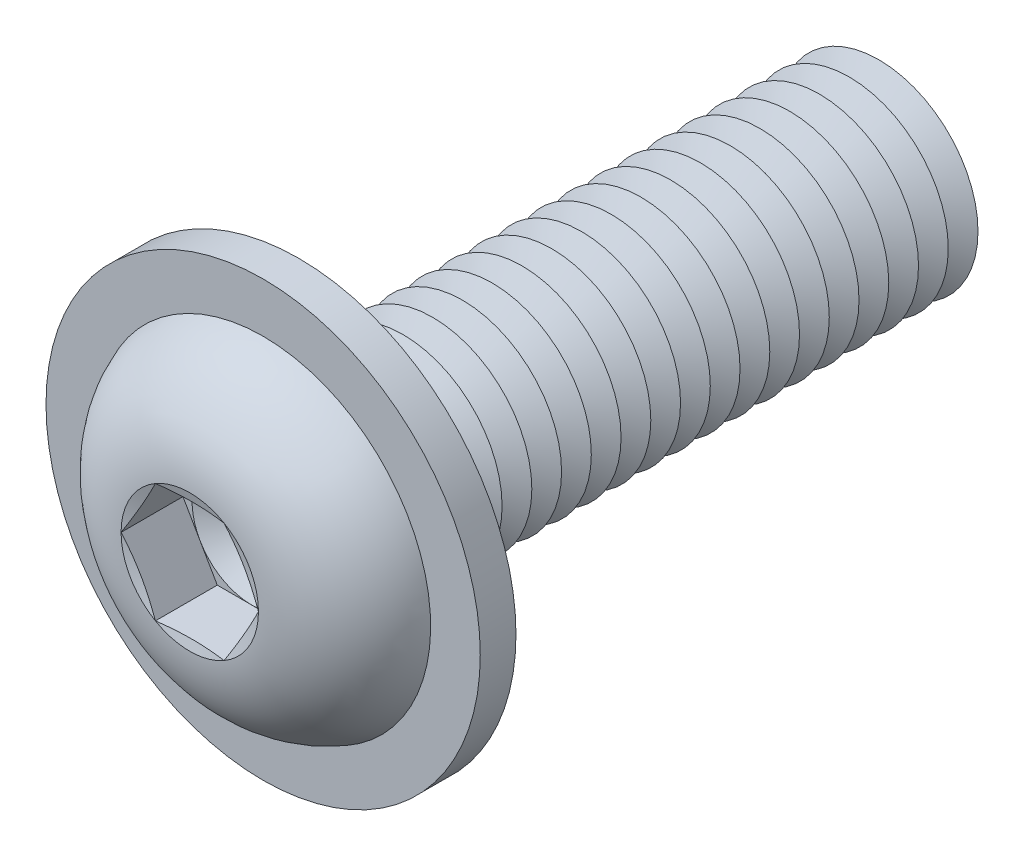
ISO-10303-21;
HEADER;
FILE_DESCRIPTION(('STEP AP214'),'2;1');
FILE_NAME('part.step','',(''),(''),'','','');
FILE_SCHEMA(('AUTOMOTIVE_DESIGN { 1 0 10303 214 1 1 1 1 }'));
ENDSEC;
DATA;
#1=APPLICATION_CONTEXT('core data for automotive mechanical design processes');
#2=APPLICATION_PROTOCOL_DEFINITION('international standard','automotive_design',2000,#1);
#3=PRODUCT_CONTEXT('',#1,'mechanical');
#4=PRODUCT('Part','Part','',(#3));
#5=PRODUCT_RELATED_PRODUCT_CATEGORY('part','',(#4));
#6=PRODUCT_DEFINITION_FORMATION('','',#4);
#7=PRODUCT_DEFINITION_CONTEXT('part definition',#1,'design');
#8=PRODUCT_DEFINITION('design','',#6,#7);
#9=PRODUCT_DEFINITION_SHAPE('','',#8);
#10=(LENGTH_UNIT() NAMED_UNIT(*) SI_UNIT(.MILLI.,.METRE.));
#11=(NAMED_UNIT(*) PLANE_ANGLE_UNIT() SI_UNIT($,.RADIAN.));
#12=(NAMED_UNIT(*) SI_UNIT($,.STERADIAN.) SOLID_ANGLE_UNIT());
#13=UNCERTAINTY_MEASURE_WITH_UNIT(LENGTH_MEASURE(1.E-05),#10,'distance_accuracy_value','');
#14=(GEOMETRIC_REPRESENTATION_CONTEXT(3) GLOBAL_UNCERTAINTY_ASSIGNED_CONTEXT((#13)) GLOBAL_UNIT_ASSIGNED_CONTEXT((#10,
#11,#12)) REPRESENTATION_CONTEXT('',''));
#15=CARTESIAN_POINT('',(0.,0.,0.));
#16=DIRECTION('',(0.,0.,1.));
#17=DIRECTION('',(1.,0.,0.));
#18=AXIS2_PLACEMENT_3D('',#15,#16,#17);
#19=CARTESIAN_POINT('',(0.,0.,-24.75));
#20=DIRECTION('',(0.,0.,1.));
#21=DIRECTION('',(0.,-1.,0.));
#22=AXIS2_PLACEMENT_3D('',#19,#20,#21);
#23=CONICAL_SURFACE('',#22,4.99999999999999,1.0471975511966);
#24=CARTESIAN_POINT('',(0.,0.,-25.5));
#25=DIRECTION('',(0.,0.,1.));
#26=DIRECTION('',(0.,-1.,0.));
#27=AXIS2_PLACEMENT_3D('',#24,#25,#26);
#28=CIRCLE('',#27,3.70096189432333);
#29=CARTESIAN_POINT('',(0.,-3.70096189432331,-25.5));
#30=VERTEX_POINT('',#29);
#31=EDGE_CURVE('E391',#30,#30,#28,.T.);
#32=ORIENTED_EDGE('',*,*,#31,.T.);
#33=EDGE_LOOP('',(#32));
#34=FACE_BOUND('',#33,.T.);
#35=CARTESIAN_POINT('',(0.,0.,-24.75));
#36=DIRECTION('',(0.,0.,1.));
#37=DIRECTION('',(0.,-1.,0.));
#38=AXIS2_PLACEMENT_3D('',#35,#36,#37);
#39=CIRCLE('',#38,4.99999999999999);
#40=CARTESIAN_POINT('',(0.,-4.99999999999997,-24.75));
#41=VERTEX_POINT('',#40);
#42=EDGE_CURVE('E387',#41,#41,#39,.T.);
#43=ORIENTED_EDGE('',*,*,#42,.F.);
#44=EDGE_LOOP('',(#43));
#45=FACE_BOUND('',#44,.T.);
#46=ADVANCED_FACE('F39',(#34,#45),#23,.T.);
#47=CARTESIAN_POINT('',(0.,0.,-25.5));
#48=DIRECTION('',(0.,0.,-1.));
#49=DIRECTION('',(0.,1.,0.));
#50=AXIS2_PLACEMENT_3D('',#47,#48,#49);
#51=CONICAL_SURFACE('',#50,3.70096189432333,1.0471975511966);
#52=CARTESIAN_POINT('',(0.,0.,-26.25));
#53=DIRECTION('',(0.,0.,1.));
#54=DIRECTION('',(0.,-1.,0.));
#55=AXIS2_PLACEMENT_3D('',#52,#53,#54);
#56=CIRCLE('',#55,4.99999999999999);
#57=CARTESIAN_POINT('',(0.,-4.99999999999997,-26.25));
#58=VERTEX_POINT('',#57);
#59=EDGE_CURVE('E345',#58,#58,#56,.T.);
#60=ORIENTED_EDGE('',*,*,#59,.T.);
#61=EDGE_LOOP('',(#60));
#62=FACE_BOUND('',#61,.T.);
#63=ORIENTED_EDGE('',*,*,#31,.F.);
#64=EDGE_LOOP('',(#63));
#65=FACE_BOUND('',#64,.T.);
#66=ADVANCED_FACE('F418',(#62,#65),#51,.T.);
#67=CARTESIAN_POINT('',(0.,5.,-30.));
#68=DIRECTION('',(0.,0.,-1.));
#69=DIRECTION('',(0.,1.,0.));
#70=AXIS2_PLACEMENT_3D('',#67,#68,#69);
#71=PLANE('',#70);
#72=CARTESIAN_POINT('',(0.,0.,-30.));
#73=DIRECTION('',(0.,0.,1.));
#74=DIRECTION('',(0.,-1.,0.));
#75=AXIS2_PLACEMENT_3D('',#72,#73,#74);
#76=CIRCLE('',#75,3.70096189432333);
#77=CARTESIAN_POINT('',(0.,-3.70096189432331,-30.));
#78=VERTEX_POINT('',#77);
#79=EDGE_CURVE('E296',#78,#78,#76,.T.);
#80=ORIENTED_EDGE('',*,*,#79,.F.);
#81=EDGE_LOOP('',(#80));
#82=FACE_BOUND('',#81,.T.);
#83=ADVANCED_FACE('F416',(#82),#71,.T.);
#84=CARTESIAN_POINT('',(0.,0.,-29.25));
#85=DIRECTION('',(0.,0.,1.));
#86=DIRECTION('',(0.,-1.,0.));
#87=AXIS2_PLACEMENT_3D('',#84,#85,#86);
#88=CONICAL_SURFACE('',#87,4.99999999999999,1.0471975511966);
#89=ORIENTED_EDGE('',*,*,#79,.T.);
#90=EDGE_LOOP('',(#89));
#91=FACE_BOUND('',#90,.T.);
#92=CARTESIAN_POINT('',(0.,0.,-29.25));
#93=DIRECTION('',(0.,0.,1.));
#94=DIRECTION('',(0.,-1.,0.));
#95=AXIS2_PLACEMENT_3D('',#92,#93,#94);
#96=CIRCLE('',#95,4.99999999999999);
#97=CARTESIAN_POINT('',(0.,-4.99999999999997,-29.25));
#98=VERTEX_POINT('',#97);
#99=EDGE_CURVE('E404',#98,#98,#96,.T.);
#100=ORIENTED_EDGE('',*,*,#99,.F.);
#101=EDGE_LOOP('',(#100));
#102=FACE_BOUND('',#101,.T.);
#103=ADVANCED_FACE('F413',(#91,#102),#88,.T.);
#104=CARTESIAN_POINT('',(0.,0.,-28.5));
#105=DIRECTION('',(0.,0.,-1.));
#106=DIRECTION('',(0.,1.,0.));
#107=AXIS2_PLACEMENT_3D('',#104,#105,#106);
#108=CONICAL_SURFACE('',#107,3.70096189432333,1.0471975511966);
#109=ORIENTED_EDGE('',*,*,#99,.T.);
#110=EDGE_LOOP('',(#109));
#111=FACE_BOUND('',#110,.T.);
#112=CARTESIAN_POINT('',(0.,0.,-28.5));
#113=DIRECTION('',(0.,0.,1.));
#114=DIRECTION('',(0.,-1.,0.));
#115=AXIS2_PLACEMENT_3D('',#112,#113,#114);
#116=CIRCLE('',#115,3.70096189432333);
#117=CARTESIAN_POINT('',(0.,-3.70096189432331,-28.5));
#118=VERTEX_POINT('',#117);
#119=EDGE_CURVE('E401',#118,#118,#116,.T.);
#120=ORIENTED_EDGE('',*,*,#119,.F.);
#121=EDGE_LOOP('',(#120));
#122=FACE_BOUND('',#121,.T.);
#123=ADVANCED_FACE('F423',(#111,#122),#108,.T.);
#124=CARTESIAN_POINT('',(0.,0.,-27.75));
#125=DIRECTION('',(0.,0.,1.));
#126=DIRECTION('',(0.,-1.,0.));
#127=AXIS2_PLACEMENT_3D('',#124,#125,#126);
#128=CONICAL_SURFACE('',#127,4.99999999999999,1.0471975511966);
#129=ORIENTED_EDGE('',*,*,#119,.T.);
#130=EDGE_LOOP('',(#129));
#131=FACE_BOUND('',#130,.T.);
#132=CARTESIAN_POINT('',(0.,0.,-27.75));
#133=DIRECTION('',(0.,0.,1.));
#134=DIRECTION('',(0.,-1.,0.));
#135=AXIS2_PLACEMENT_3D('',#132,#133,#134);
#136=CIRCLE('',#135,4.99999999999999);
#137=CARTESIAN_POINT('',(0.,-4.99999999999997,-27.75));
#138=VERTEX_POINT('',#137);
#139=EDGE_CURVE('E344',#138,#138,#136,.T.);
#140=ORIENTED_EDGE('',*,*,#139,.F.);
#141=EDGE_LOOP('',(#140));
#142=FACE_BOUND('',#141,.T.);
#143=ADVANCED_FACE('F439',(#131,#142),#128,.T.);
#144=CARTESIAN_POINT('',(0.,0.,-27.));
#145=DIRECTION('',(0.,0.,-1.));
#146=DIRECTION('',(0.,1.,0.));
#147=AXIS2_PLACEMENT_3D('',#144,#145,#146);
#148=CONICAL_SURFACE('',#147,3.70096189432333,1.0471975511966);
#149=ORIENTED_EDGE('',*,*,#139,.T.);
#150=EDGE_LOOP('',(#149));
#151=FACE_BOUND('',#150,.T.);
#152=CARTESIAN_POINT('',(0.,0.,-27.));
#153=DIRECTION('',(0.,0.,1.));
#154=DIRECTION('',(0.,-1.,0.));
#155=AXIS2_PLACEMENT_3D('',#152,#153,#154);
#156=CIRCLE('',#155,3.70096189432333);
#157=CARTESIAN_POINT('',(0.,-3.70096189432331,-27.));
#158=VERTEX_POINT('',#157);
#159=EDGE_CURVE('E341',#158,#158,#156,.T.);
#160=ORIENTED_EDGE('',*,*,#159,.F.);
#161=EDGE_LOOP('',(#160));
#162=FACE_BOUND('',#161,.T.);
#163=ADVANCED_FACE('F435',(#151,#162),#148,.T.);
#164=CARTESIAN_POINT('',(0.,0.,-26.25));
#165=DIRECTION('',(0.,0.,1.));
#166=DIRECTION('',(0.,-1.,0.));
#167=AXIS2_PLACEMENT_3D('',#164,#165,#166);
#168=CONICAL_SURFACE('',#167,4.99999999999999,1.0471975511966);
#169=ORIENTED_EDGE('',*,*,#159,.T.);
#170=EDGE_LOOP('',(#169));
#171=FACE_BOUND('',#170,.T.);
#172=ORIENTED_EDGE('',*,*,#59,.F.);
#173=EDGE_LOOP('',(#172));
#174=FACE_BOUND('',#173,.T.);
#175=ADVANCED_FACE('F438',(#171,#174),#168,.T.);
#176=CARTESIAN_POINT('',(0.,0.,-23.25));
#177=DIRECTION('',(0.,0.,1.));
#178=DIRECTION('',(0.,-1.,0.));
#179=AXIS2_PLACEMENT_3D('',#176,#177,#178);
#180=CONICAL_SURFACE('',#179,4.99999999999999,1.0471975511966);
#181=CARTESIAN_POINT('',(0.,0.,-24.));
#182=DIRECTION('',(0.,0.,1.));
#183=DIRECTION('',(0.,-1.,0.));
#184=AXIS2_PLACEMENT_3D('',#181,#182,#183);
#185=CIRCLE('',#184,3.70096189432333);
#186=CARTESIAN_POINT('',(0.,-3.70096189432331,-24.));
#187=VERTEX_POINT('',#186);
#188=EDGE_CURVE('E383',#187,#187,#185,.T.);
#189=ORIENTED_EDGE('',*,*,#188,.T.);
#190=EDGE_LOOP('',(#189));
#191=FACE_BOUND('',#190,.T.);
#192=CARTESIAN_POINT('',(0.,0.,-23.25));
#193=DIRECTION('',(0.,0.,1.));
#194=DIRECTION('',(0.,-1.,0.));
#195=AXIS2_PLACEMENT_3D('',#192,#193,#194);
#196=CIRCLE('',#195,4.99999999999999);
#197=CARTESIAN_POINT('',(0.,-4.99999999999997,-23.25));
#198=VERTEX_POINT('',#197);
#199=EDGE_CURVE('E379',#198,#198,#196,.T.);
#200=ORIENTED_EDGE('',*,*,#199,.F.);
#201=EDGE_LOOP('',(#200));
#202=FACE_BOUND('',#201,.T.);
#203=ADVANCED_FACE('F443',(#191,#202),#180,.T.);
#204=CARTESIAN_POINT('',(0.,0.,-24.));
#205=DIRECTION('',(0.,0.,-1.));
#206=DIRECTION('',(0.,1.,0.));
#207=AXIS2_PLACEMENT_3D('',#204,#205,#206);
#208=CONICAL_SURFACE('',#207,3.70096189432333,1.0471975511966);
#209=ORIENTED_EDGE('',*,*,#42,.T.);
#210=EDGE_LOOP('',(#209));
#211=FACE_BOUND('',#210,.T.);
#212=ORIENTED_EDGE('',*,*,#188,.F.);
#213=EDGE_LOOP('',(#212));
#214=FACE_BOUND('',#213,.T.);
#215=ADVANCED_FACE('F474',(#211,#214),#208,.T.);
#216=CARTESIAN_POINT('',(0.,0.,-21.75));
#217=DIRECTION('',(0.,0.,1.));
#218=DIRECTION('',(0.,-1.,0.));
#219=AXIS2_PLACEMENT_3D('',#216,#217,#218);
#220=CONICAL_SURFACE('',#219,4.99999999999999,1.0471975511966);
#221=CARTESIAN_POINT('',(0.,0.,-22.5));
#222=DIRECTION('',(0.,0.,1.));
#223=DIRECTION('',(0.,-1.,0.));
#224=AXIS2_PLACEMENT_3D('',#221,#222,#223);
#225=CIRCLE('',#224,3.70096189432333);
#226=CARTESIAN_POINT('',(0.,-3.70096189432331,-22.5));
#227=VERTEX_POINT('',#226);
#228=EDGE_CURVE('E352',#227,#227,#225,.T.);
#229=ORIENTED_EDGE('',*,*,#228,.T.);
#230=EDGE_LOOP('',(#229));
#231=FACE_BOUND('',#230,.T.);
#232=CARTESIAN_POINT('',(0.,0.,-21.75));
#233=DIRECTION('',(0.,0.,1.));
#234=DIRECTION('',(0.,-1.,0.));
#235=AXIS2_PLACEMENT_3D('',#232,#233,#234);
#236=CIRCLE('',#235,4.99999999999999);
#237=CARTESIAN_POINT('',(0.,-4.99999999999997,-21.75));
#238=VERTEX_POINT('',#237);
#239=EDGE_CURVE('E350',#238,#238,#236,.T.);
#240=ORIENTED_EDGE('',*,*,#239,.F.);
#241=EDGE_LOOP('',(#240));
#242=FACE_BOUND('',#241,.T.);
#243=ADVANCED_FACE('F480',(#231,#242),#220,.T.);
#244=CARTESIAN_POINT('',(0.,0.,-22.5));
#245=DIRECTION('',(0.,0.,-1.));
#246=DIRECTION('',(0.,1.,0.));
#247=AXIS2_PLACEMENT_3D('',#244,#245,#246);
#248=CONICAL_SURFACE('',#247,3.70096189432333,1.0471975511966);
#249=ORIENTED_EDGE('',*,*,#199,.T.);
#250=EDGE_LOOP('',(#249));
#251=FACE_BOUND('',#250,.T.);
#252=ORIENTED_EDGE('',*,*,#228,.F.);
#253=EDGE_LOOP('',(#252));
#254=FACE_BOUND('',#253,.T.);
#255=ADVANCED_FACE('F487',(#251,#254),#248,.T.);
#256=CARTESIAN_POINT('',(0.,0.,-20.25));
#257=DIRECTION('',(0.,0.,1.));
#258=DIRECTION('',(0.,-1.,0.));
#259=AXIS2_PLACEMENT_3D('',#256,#257,#258);
#260=CONICAL_SURFACE('',#259,4.99999999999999,1.0471975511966);
#261=CARTESIAN_POINT('',(0.,0.,-21.));
#262=DIRECTION('',(0.,0.,1.));
#263=DIRECTION('',(0.,-1.,0.));
#264=AXIS2_PLACEMENT_3D('',#261,#262,#263);
#265=CIRCLE('',#264,3.70096189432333);
#266=CARTESIAN_POINT('',(0.,-3.70096189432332,-21.));
#267=VERTEX_POINT('',#266);
#268=EDGE_CURVE('E353',#267,#267,#265,.T.);
#269=ORIENTED_EDGE('',*,*,#268,.T.);
#270=EDGE_LOOP('',(#269));
#271=FACE_BOUND('',#270,.T.);
#272=CARTESIAN_POINT('',(0.,0.,-20.25));
#273=DIRECTION('',(0.,0.,1.));
#274=DIRECTION('',(0.,-1.,0.));
#275=AXIS2_PLACEMENT_3D('',#272,#273,#274);
#276=CIRCLE('',#275,4.99999999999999);
#277=CARTESIAN_POINT('',(0.,-4.99999999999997,-20.25));
#278=VERTEX_POINT('',#277);
#279=EDGE_CURVE('E366',#278,#278,#276,.T.);
#280=ORIENTED_EDGE('',*,*,#279,.F.);
#281=EDGE_LOOP('',(#280));
#282=FACE_BOUND('',#281,.T.);
#283=ADVANCED_FACE('F494',(#271,#282),#260,.T.);
#284=CARTESIAN_POINT('',(0.,0.,-21.));
#285=DIRECTION('',(0.,0.,-1.));
#286=DIRECTION('',(0.,1.,0.));
#287=AXIS2_PLACEMENT_3D('',#284,#285,#286);
#288=CONICAL_SURFACE('',#287,3.70096189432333,1.0471975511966);
#289=ORIENTED_EDGE('',*,*,#239,.T.);
#290=EDGE_LOOP('',(#289));
#291=FACE_BOUND('',#290,.T.);
#292=ORIENTED_EDGE('',*,*,#268,.F.);
#293=EDGE_LOOP('',(#292));
#294=FACE_BOUND('',#293,.T.);
#295=ADVANCED_FACE('F501',(#291,#294),#288,.T.);
#296=CARTESIAN_POINT('',(0.,0.,-18.75));
#297=DIRECTION('',(0.,0.,1.));
#298=DIRECTION('',(0.,-1.,0.));
#299=AXIS2_PLACEMENT_3D('',#296,#297,#298);
#300=CONICAL_SURFACE('',#299,4.99999999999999,1.0471975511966);
#301=CARTESIAN_POINT('',(0.,0.,-19.5));
#302=DIRECTION('',(0.,0.,1.));
#303=DIRECTION('',(0.,-1.,0.));
#304=AXIS2_PLACEMENT_3D('',#301,#302,#303);
#305=CIRCLE('',#304,3.70096189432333);
#306=CARTESIAN_POINT('',(0.,-3.70096189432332,-19.5));
#307=VERTEX_POINT('',#306);
#308=EDGE_CURVE('E372',#307,#307,#305,.T.);
#309=ORIENTED_EDGE('',*,*,#308,.T.);
#310=EDGE_LOOP('',(#309));
#311=FACE_BOUND('',#310,.T.);
#312=CARTESIAN_POINT('',(0.,0.,-18.75));
#313=DIRECTION('',(0.,0.,1.));
#314=DIRECTION('',(0.,-1.,0.));
#315=AXIS2_PLACEMENT_3D('',#312,#313,#314);
#316=CIRCLE('',#315,4.99999999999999);
#317=CARTESIAN_POINT('',(0.,-4.99999999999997,-18.75));
#318=VERTEX_POINT('',#317);
#319=EDGE_CURVE('E363',#318,#318,#316,.T.);
#320=ORIENTED_EDGE('',*,*,#319,.F.);
#321=EDGE_LOOP('',(#320));
#322=FACE_BOUND('',#321,.T.);
#323=ADVANCED_FACE('F507',(#311,#322),#300,.T.);
#324=CARTESIAN_POINT('',(0.,0.,-19.5));
#325=DIRECTION('',(0.,0.,-1.));
#326=DIRECTION('',(0.,1.,0.));
#327=AXIS2_PLACEMENT_3D('',#324,#325,#326);
#328=CONICAL_SURFACE('',#327,3.70096189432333,1.0471975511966);
#329=ORIENTED_EDGE('',*,*,#279,.T.);
#330=EDGE_LOOP('',(#329));
#331=FACE_BOUND('',#330,.T.);
#332=ORIENTED_EDGE('',*,*,#308,.F.);
#333=EDGE_LOOP('',(#332));
#334=FACE_BOUND('',#333,.T.);
#335=ADVANCED_FACE('F514',(#331,#334),#328,.T.);
#336=CARTESIAN_POINT('',(0.,0.,-17.25));
#337=DIRECTION('',(0.,0.,1.));
#338=DIRECTION('',(0.,-1.,0.));
#339=AXIS2_PLACEMENT_3D('',#336,#337,#338);
#340=CONICAL_SURFACE('',#339,4.99999999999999,1.0471975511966);
#341=CARTESIAN_POINT('',(0.,0.,-18.));
#342=DIRECTION('',(0.,0.,1.));
#343=DIRECTION('',(0.,-1.,0.));
#344=AXIS2_PLACEMENT_3D('',#341,#342,#343);
#345=CIRCLE('',#344,3.70096189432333);
#346=CARTESIAN_POINT('',(0.,-3.70096189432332,-18.));
#347=VERTEX_POINT('',#346);
#348=EDGE_CURVE('E339',#347,#347,#345,.T.);
#349=ORIENTED_EDGE('',*,*,#348,.T.);
#350=EDGE_LOOP('',(#349));
#351=FACE_BOUND('',#350,.T.);
#352=CARTESIAN_POINT('',(0.,0.,-17.25));
#353=DIRECTION('',(0.,0.,1.));
#354=DIRECTION('',(0.,-1.,0.));
#355=AXIS2_PLACEMENT_3D('',#352,#353,#354);
#356=CIRCLE('',#355,4.99999999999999);
#357=CARTESIAN_POINT('',(0.,-4.99999999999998,-17.25));
#358=VERTEX_POINT('',#357);
#359=EDGE_CURVE('E336',#358,#358,#356,.T.);
#360=ORIENTED_EDGE('',*,*,#359,.F.);
#361=EDGE_LOOP('',(#360));
#362=FACE_BOUND('',#361,.T.);
#363=ADVANCED_FACE('F521',(#351,#362),#340,.T.);
#364=CARTESIAN_POINT('',(0.,0.,-18.));
#365=DIRECTION('',(0.,0.,-1.));
#366=DIRECTION('',(0.,1.,0.));
#367=AXIS2_PLACEMENT_3D('',#364,#365,#366);
#368=CONICAL_SURFACE('',#367,3.70096189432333,1.0471975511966);
#369=ORIENTED_EDGE('',*,*,#319,.T.);
#370=EDGE_LOOP('',(#369));
#371=FACE_BOUND('',#370,.T.);
#372=ORIENTED_EDGE('',*,*,#348,.F.);
#373=EDGE_LOOP('',(#372));
#374=FACE_BOUND('',#373,.T.);
#375=ADVANCED_FACE('F528',(#371,#374),#368,.T.);
#376=CARTESIAN_POINT('',(0.,0.,-15.75));
#377=DIRECTION('',(0.,0.,1.));
#378=DIRECTION('',(0.,-1.,0.));
#379=AXIS2_PLACEMENT_3D('',#376,#377,#378);
#380=CONICAL_SURFACE('',#379,4.99999999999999,1.0471975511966);
#381=CARTESIAN_POINT('',(0.,0.,-16.5));
#382=DIRECTION('',(0.,0.,1.));
#383=DIRECTION('',(0.,-1.,0.));
#384=AXIS2_PLACEMENT_3D('',#381,#382,#383);
#385=CIRCLE('',#384,3.70096189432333);
#386=CARTESIAN_POINT('',(0.,-3.70096189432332,-16.5));
#387=VERTEX_POINT('',#386);
#388=EDGE_CURVE('E323',#387,#387,#385,.T.);
#389=ORIENTED_EDGE('',*,*,#388,.T.);
#390=EDGE_LOOP('',(#389));
#391=FACE_BOUND('',#390,.T.);
#392=CARTESIAN_POINT('',(0.,0.,-15.75));
#393=DIRECTION('',(0.,0.,1.));
#394=DIRECTION('',(0.,-1.,0.));
#395=AXIS2_PLACEMENT_3D('',#392,#393,#394);
#396=CIRCLE('',#395,4.99999999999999);
#397=CARTESIAN_POINT('',(0.,-4.99999999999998,-15.75));
#398=VERTEX_POINT('',#397);
#399=EDGE_CURVE('E1145',#398,#398,#396,.T.);
#400=ORIENTED_EDGE('',*,*,#399,.F.);
#401=EDGE_LOOP('',(#400));
#402=FACE_BOUND('',#401,.T.);
#403=ADVANCED_FACE('F535',(#391,#402),#380,.T.);
#404=CARTESIAN_POINT('',(0.,0.,-16.5));
#405=DIRECTION('',(0.,0.,-1.));
#406=DIRECTION('',(0.,1.,0.));
#407=AXIS2_PLACEMENT_3D('',#404,#405,#406);
#408=CONICAL_SURFACE('',#407,3.70096189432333,1.0471975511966);
#409=ORIENTED_EDGE('',*,*,#359,.T.);
#410=EDGE_LOOP('',(#409));
#411=FACE_BOUND('',#410,.T.);
#412=ORIENTED_EDGE('',*,*,#388,.F.);
#413=EDGE_LOOP('',(#412));
#414=FACE_BOUND('',#413,.T.);
#415=ADVANCED_FACE('F542',(#411,#414),#408,.T.);
#416=CARTESIAN_POINT('',(0.,0.,-14.25));
#417=DIRECTION('',(0.,0.,1.));
#418=DIRECTION('',(0.,-1.,0.));
#419=AXIS2_PLACEMENT_3D('',#416,#417,#418);
#420=CONICAL_SURFACE('',#419,4.99999999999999,1.0471975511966);
#421=CARTESIAN_POINT('',(0.,0.,-15.));
#422=DIRECTION('',(0.,0.,1.));
#423=DIRECTION('',(0.,-1.,0.));
#424=AXIS2_PLACEMENT_3D('',#421,#422,#423);
#425=CIRCLE('',#424,3.70096189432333);
#426=CARTESIAN_POINT('',(0.,-3.70096189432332,-15.));
#427=VERTEX_POINT('',#426);
#428=EDGE_CURVE('E1149',#427,#427,#425,.T.);
#429=ORIENTED_EDGE('',*,*,#428,.T.);
#430=EDGE_LOOP('',(#429));
#431=FACE_BOUND('',#430,.T.);
#432=CARTESIAN_POINT('',(0.,0.,-14.25));
#433=DIRECTION('',(0.,0.,1.));
#434=DIRECTION('',(0.,-1.,0.));
#435=AXIS2_PLACEMENT_3D('',#432,#433,#434);
#436=CIRCLE('',#435,4.99999999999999);
#437=CARTESIAN_POINT('',(0.,-4.99999999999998,-14.25));
#438=VERTEX_POINT('',#437);
#439=EDGE_CURVE('E1153',#438,#438,#436,.T.);
#440=ORIENTED_EDGE('',*,*,#439,.F.);
#441=EDGE_LOOP('',(#440));
#442=FACE_BOUND('',#441,.T.);
#443=ADVANCED_FACE('F549',(#431,#442),#420,.T.);
#444=CARTESIAN_POINT('',(0.,0.,-15.));
#445=DIRECTION('',(0.,0.,-1.));
#446=DIRECTION('',(0.,1.,0.));
#447=AXIS2_PLACEMENT_3D('',#444,#445,#446);
#448=CONICAL_SURFACE('',#447,3.70096189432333,1.0471975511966);
#449=ORIENTED_EDGE('',*,*,#399,.T.);
#450=EDGE_LOOP('',(#449));
#451=FACE_BOUND('',#450,.T.);
#452=ORIENTED_EDGE('',*,*,#428,.F.);
#453=EDGE_LOOP('',(#452));
#454=FACE_BOUND('',#453,.T.);
#455=ADVANCED_FACE('F556',(#451,#454),#448,.T.);
#456=CARTESIAN_POINT('',(0.,0.,-12.75));
#457=DIRECTION('',(0.,0.,1.));
#458=DIRECTION('',(0.,-1.,0.));
#459=AXIS2_PLACEMENT_3D('',#456,#457,#458);
#460=CONICAL_SURFACE('',#459,4.99999999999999,1.0471975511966);
#461=CARTESIAN_POINT('',(0.,0.,-13.5));
#462=DIRECTION('',(0.,0.,1.));
#463=DIRECTION('',(0.,-1.,0.));
#464=AXIS2_PLACEMENT_3D('',#461,#462,#463);
#465=CIRCLE('',#464,3.70096189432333);
#466=CARTESIAN_POINT('',(0.,-3.70096189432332,-13.5));
#467=VERTEX_POINT('',#466);
#468=EDGE_CURVE('E1157',#467,#467,#465,.T.);
#469=ORIENTED_EDGE('',*,*,#468,.T.);
#470=EDGE_LOOP('',(#469));
#471=FACE_BOUND('',#470,.T.);
#472=CARTESIAN_POINT('',(0.,0.,-12.75));
#473=DIRECTION('',(0.,0.,1.));
#474=DIRECTION('',(0.,-1.,0.));
#475=AXIS2_PLACEMENT_3D('',#472,#473,#474);
#476=CIRCLE('',#475,4.99999999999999);
#477=CARTESIAN_POINT('',(0.,-4.99999999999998,-12.75));
#478=VERTEX_POINT('',#477);
#479=EDGE_CURVE('E1161',#478,#478,#476,.T.);
#480=ORIENTED_EDGE('',*,*,#479,.F.);
#481=EDGE_LOOP('',(#480));
#482=FACE_BOUND('',#481,.T.);
#483=ADVANCED_FACE('F563',(#471,#482),#460,.T.);
#484=CARTESIAN_POINT('',(0.,0.,-13.5));
#485=DIRECTION('',(0.,0.,-1.));
#486=DIRECTION('',(0.,1.,0.));
#487=AXIS2_PLACEMENT_3D('',#484,#485,#486);
#488=CONICAL_SURFACE('',#487,3.70096189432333,1.0471975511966);
#489=ORIENTED_EDGE('',*,*,#439,.T.);
#490=EDGE_LOOP('',(#489));
#491=FACE_BOUND('',#490,.T.);
#492=ORIENTED_EDGE('',*,*,#468,.F.);
#493=EDGE_LOOP('',(#492));
#494=FACE_BOUND('',#493,.T.);
#495=ADVANCED_FACE('F570',(#491,#494),#488,.T.);
#496=CARTESIAN_POINT('',(0.,0.,-11.25));
#497=DIRECTION('',(0.,0.,1.));
#498=DIRECTION('',(0.,-1.,0.));
#499=AXIS2_PLACEMENT_3D('',#496,#497,#498);
#500=CONICAL_SURFACE('',#499,4.99999999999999,1.0471975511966);
#501=CARTESIAN_POINT('',(0.,0.,-12.));
#502=DIRECTION('',(0.,0.,1.));
#503=DIRECTION('',(0.,-1.,0.));
#504=AXIS2_PLACEMENT_3D('',#501,#502,#503);
#505=CIRCLE('',#504,3.70096189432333);
#506=CARTESIAN_POINT('',(0.,-3.70096189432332,-12.));
#507=VERTEX_POINT('',#506);
#508=EDGE_CURVE('E1165',#507,#507,#505,.T.);
#509=ORIENTED_EDGE('',*,*,#508,.T.);
#510=EDGE_LOOP('',(#509));
#511=FACE_BOUND('',#510,.T.);
#512=CARTESIAN_POINT('',(0.,0.,-11.25));
#513=DIRECTION('',(0.,0.,1.));
#514=DIRECTION('',(0.,-1.,0.));
#515=AXIS2_PLACEMENT_3D('',#512,#513,#514);
#516=CIRCLE('',#515,4.99999999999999);
#517=CARTESIAN_POINT('',(0.,-4.99999999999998,-11.25));
#518=VERTEX_POINT('',#517);
#519=EDGE_CURVE('E1168',#518,#518,#516,.T.);
#520=ORIENTED_EDGE('',*,*,#519,.F.);
#521=EDGE_LOOP('',(#520));
#522=FACE_BOUND('',#521,.T.);
#523=ADVANCED_FACE('F577',(#511,#522),#500,.T.);
#524=CARTESIAN_POINT('',(0.,0.,-12.));
#525=DIRECTION('',(0.,0.,-1.));
#526=DIRECTION('',(0.,1.,0.));
#527=AXIS2_PLACEMENT_3D('',#524,#525,#526);
#528=CONICAL_SURFACE('',#527,3.70096189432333,1.0471975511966);
#529=ORIENTED_EDGE('',*,*,#479,.T.);
#530=EDGE_LOOP('',(#529));
#531=FACE_BOUND('',#530,.T.);
#532=ORIENTED_EDGE('',*,*,#508,.F.);
#533=EDGE_LOOP('',(#532));
#534=FACE_BOUND('',#533,.T.);
#535=ADVANCED_FACE('F584',(#531,#534),#528,.T.);
#536=CARTESIAN_POINT('',(0.,0.,-9.75));
#537=DIRECTION('',(0.,0.,1.));
#538=DIRECTION('',(0.,-1.,0.));
#539=AXIS2_PLACEMENT_3D('',#536,#537,#538);
#540=CONICAL_SURFACE('',#539,4.99999999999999,1.0471975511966);
#541=CARTESIAN_POINT('',(0.,0.,-10.5));
#542=DIRECTION('',(0.,0.,1.));
#543=DIRECTION('',(0.,-1.,0.));
#544=AXIS2_PLACEMENT_3D('',#541,#542,#543);
#545=CIRCLE('',#544,3.70096189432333);
#546=CARTESIAN_POINT('',(0.,-3.70096189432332,-10.5));
#547=VERTEX_POINT('',#546);
#548=EDGE_CURVE('E1172',#547,#547,#545,.T.);
#549=ORIENTED_EDGE('',*,*,#548,.T.);
#550=EDGE_LOOP('',(#549));
#551=FACE_BOUND('',#550,.T.);
#552=CARTESIAN_POINT('',(0.,0.,-9.75));
#553=DIRECTION('',(0.,0.,1.));
#554=DIRECTION('',(0.,-1.,0.));
#555=AXIS2_PLACEMENT_3D('',#552,#553,#554);
#556=CIRCLE('',#555,4.99999999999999);
#557=CARTESIAN_POINT('',(0.,-4.99999999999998,-9.75));
#558=VERTEX_POINT('',#557);
#559=EDGE_CURVE('E1176',#558,#558,#556,.T.);
#560=ORIENTED_EDGE('',*,*,#559,.F.);
#561=EDGE_LOOP('',(#560));
#562=FACE_BOUND('',#561,.T.);
#563=ADVANCED_FACE('F591',(#551,#562),#540,.T.);
#564=CARTESIAN_POINT('',(0.,0.,-10.5));
#565=DIRECTION('',(0.,0.,-1.));
#566=DIRECTION('',(0.,1.,0.));
#567=AXIS2_PLACEMENT_3D('',#564,#565,#566);
#568=CONICAL_SURFACE('',#567,3.70096189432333,1.0471975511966);
#569=ORIENTED_EDGE('',*,*,#519,.T.);
#570=EDGE_LOOP('',(#569));
#571=FACE_BOUND('',#570,.T.);
#572=ORIENTED_EDGE('',*,*,#548,.F.);
#573=EDGE_LOOP('',(#572));
#574=FACE_BOUND('',#573,.T.);
#575=ADVANCED_FACE('F598',(#571,#574),#568,.T.);
#576=CARTESIAN_POINT('',(0.,0.,-8.25));
#577=DIRECTION('',(0.,0.,1.));
#578=DIRECTION('',(0.,-1.,0.));
#579=AXIS2_PLACEMENT_3D('',#576,#577,#578);
#580=CONICAL_SURFACE('',#579,4.99999999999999,1.0471975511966);
#581=CARTESIAN_POINT('',(0.,0.,-9.));
#582=DIRECTION('',(0.,0.,1.));
#583=DIRECTION('',(0.,-1.,0.));
#584=AXIS2_PLACEMENT_3D('',#581,#582,#583);
#585=CIRCLE('',#584,3.70096189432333);
#586=CARTESIAN_POINT('',(0.,-3.70096189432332,-9.));
#587=VERTEX_POINT('',#586);
#588=EDGE_CURVE('E1120',#587,#587,#585,.T.);
#589=ORIENTED_EDGE('',*,*,#588,.T.);
#590=EDGE_LOOP('',(#589));
#591=FACE_BOUND('',#590,.T.);
#592=CARTESIAN_POINT('',(0.,0.,-8.25));
#593=DIRECTION('',(0.,0.,1.));
#594=DIRECTION('',(0.,-1.,0.));
#595=AXIS2_PLACEMENT_3D('',#592,#593,#594);
#596=CIRCLE('',#595,4.99999999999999);
#597=CARTESIAN_POINT('',(0.,-4.99999999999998,-8.25000000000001));
#598=VERTEX_POINT('',#597);
#599=EDGE_CURVE('E1182',#598,#598,#596,.T.);
#600=ORIENTED_EDGE('',*,*,#599,.F.);
#601=EDGE_LOOP('',(#600));
#602=FACE_BOUND('',#601,.T.);
#603=ADVANCED_FACE('F605',(#591,#602),#580,.T.);
#604=CARTESIAN_POINT('',(0.,0.,-9.));
#605=DIRECTION('',(0.,0.,-1.));
#606=DIRECTION('',(0.,1.,0.));
#607=AXIS2_PLACEMENT_3D('',#604,#605,#606);
#608=CONICAL_SURFACE('',#607,3.70096189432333,1.0471975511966);
#609=ORIENTED_EDGE('',*,*,#559,.T.);
#610=EDGE_LOOP('',(#609));
#611=FACE_BOUND('',#610,.T.);
#612=ORIENTED_EDGE('',*,*,#588,.F.);
#613=EDGE_LOOP('',(#612));
#614=FACE_BOUND('',#613,.T.);
#615=ADVANCED_FACE('F612',(#611,#614),#608,.T.);
#616=CARTESIAN_POINT('',(0.,0.,-6.75));
#617=DIRECTION('',(0.,0.,1.));
#618=DIRECTION('',(0.,-1.,0.));
#619=AXIS2_PLACEMENT_3D('',#616,#617,#618);
#620=CONICAL_SURFACE('',#619,4.99999999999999,1.0471975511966);
#621=CARTESIAN_POINT('',(0.,0.,-7.5));
#622=DIRECTION('',(0.,0.,1.));
#623=DIRECTION('',(0.,-1.,0.));
#624=AXIS2_PLACEMENT_3D('',#621,#622,#623);
#625=CIRCLE('',#624,3.70096189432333);
#626=CARTESIAN_POINT('',(0.,-3.70096189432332,-7.50000000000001));
#627=VERTEX_POINT('',#626);
#628=EDGE_CURVE('E1185',#627,#627,#625,.T.);
#629=ORIENTED_EDGE('',*,*,#628,.T.);
#630=EDGE_LOOP('',(#629));
#631=FACE_BOUND('',#630,.T.);
#632=CARTESIAN_POINT('',(0.,0.,-6.75));
#633=DIRECTION('',(0.,0.,1.));
#634=DIRECTION('',(0.,-1.,0.));
#635=AXIS2_PLACEMENT_3D('',#632,#633,#634);
#636=CIRCLE('',#635,4.99999999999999);
#637=CARTESIAN_POINT('',(0.,-4.99999999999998,-6.75000000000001));
#638=VERTEX_POINT('',#637);
#639=EDGE_CURVE('E1189',#638,#638,#636,.T.);
#640=ORIENTED_EDGE('',*,*,#639,.F.);
#641=EDGE_LOOP('',(#640));
#642=FACE_BOUND('',#641,.T.);
#643=ADVANCED_FACE('F619',(#631,#642),#620,.T.);
#644=CARTESIAN_POINT('',(0.,0.,-7.5));
#645=DIRECTION('',(0.,0.,-1.));
#646=DIRECTION('',(0.,1.,0.));
#647=AXIS2_PLACEMENT_3D('',#644,#645,#646);
#648=CONICAL_SURFACE('',#647,3.70096189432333,1.0471975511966);
#649=ORIENTED_EDGE('',*,*,#599,.T.);
#650=EDGE_LOOP('',(#649));
#651=FACE_BOUND('',#650,.T.);
#652=ORIENTED_EDGE('',*,*,#628,.F.);
#653=EDGE_LOOP('',(#652));
#654=FACE_BOUND('',#653,.T.);
#655=ADVANCED_FACE('F626',(#651,#654),#648,.T.);
#656=CARTESIAN_POINT('',(0.,0.,-5.25));
#657=DIRECTION('',(0.,0.,1.));
#658=DIRECTION('',(0.,-1.,0.));
#659=AXIS2_PLACEMENT_3D('',#656,#657,#658);
#660=CONICAL_SURFACE('',#659,4.99999999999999,1.0471975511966);
#661=CARTESIAN_POINT('',(0.,0.,-6.));
#662=DIRECTION('',(0.,0.,1.));
#663=DIRECTION('',(0.,-1.,0.));
#664=AXIS2_PLACEMENT_3D('',#661,#662,#663);
#665=CIRCLE('',#664,3.70096189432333);
#666=CARTESIAN_POINT('',(0.,-3.70096189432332,-6.));
#667=VERTEX_POINT('',#666);
#668=EDGE_CURVE('E334',#667,#667,#665,.T.);
#669=ORIENTED_EDGE('',*,*,#668,.T.);
#670=EDGE_LOOP('',(#669));
#671=FACE_BOUND('',#670,.T.);
#672=CARTESIAN_POINT('',(0.,0.,-5.25));
#673=DIRECTION('',(0.,0.,1.));
#674=DIRECTION('',(0.,-1.,0.));
#675=AXIS2_PLACEMENT_3D('',#672,#673,#674);
#676=CIRCLE('',#675,4.99999999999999);
#677=CARTESIAN_POINT('',(0.,-4.99999999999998,-5.25));
#678=VERTEX_POINT('',#677);
#679=EDGE_CURVE('E331',#678,#678,#676,.T.);
#680=ORIENTED_EDGE('',*,*,#679,.F.);
#681=EDGE_LOOP('',(#680));
#682=FACE_BOUND('',#681,.T.);
#683=ADVANCED_FACE('F633',(#671,#682),#660,.T.);
#684=CARTESIAN_POINT('',(0.,0.,-6.));
#685=DIRECTION('',(0.,0.,-1.));
#686=DIRECTION('',(0.,1.,0.));
#687=AXIS2_PLACEMENT_3D('',#684,#685,#686);
#688=CONICAL_SURFACE('',#687,3.70096189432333,1.0471975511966);
#689=ORIENTED_EDGE('',*,*,#639,.T.);
#690=EDGE_LOOP('',(#689));
#691=FACE_BOUND('',#690,.T.);
#692=ORIENTED_EDGE('',*,*,#668,.F.);
#693=EDGE_LOOP('',(#692));
#694=FACE_BOUND('',#693,.T.);
#695=ADVANCED_FACE('F640',(#691,#694),#688,.T.);
#696=CARTESIAN_POINT('',(0.,0.,-3.75));
#697=DIRECTION('',(0.,0.,1.));
#698=DIRECTION('',(0.,-1.,0.));
#699=AXIS2_PLACEMENT_3D('',#696,#697,#698);
#700=CONICAL_SURFACE('',#699,4.99999999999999,1.0471975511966);
#701=CARTESIAN_POINT('',(0.,0.,-4.5));
#702=DIRECTION('',(0.,0.,1.));
#703=DIRECTION('',(0.,-1.,0.));
#704=AXIS2_PLACEMENT_3D('',#701,#702,#703);
#705=CIRCLE('',#704,3.70096189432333);
#706=CARTESIAN_POINT('',(0.,-3.70096189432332,-4.5));
#707=VERTEX_POINT('',#706);
#708=EDGE_CURVE('E328',#707,#707,#705,.T.);
#709=ORIENTED_EDGE('',*,*,#708,.T.);
#710=EDGE_LOOP('',(#709));
#711=FACE_BOUND('',#710,.T.);
#712=CARTESIAN_POINT('',(0.,0.,-3.75));
#713=DIRECTION('',(0.,0.,1.));
#714=DIRECTION('',(0.,-1.,0.));
#715=AXIS2_PLACEMENT_3D('',#712,#713,#714);
#716=CIRCLE('',#715,4.99999999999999);
#717=CARTESIAN_POINT('',(0.,-4.99999999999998,-3.75000000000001));
#718=VERTEX_POINT('',#717);
#719=EDGE_CURVE('E325',#718,#718,#716,.T.);
#720=ORIENTED_EDGE('',*,*,#719,.F.);
#721=EDGE_LOOP('',(#720));
#722=FACE_BOUND('',#721,.T.);
#723=ADVANCED_FACE('F647',(#711,#722),#700,.T.);
#724=CARTESIAN_POINT('',(0.,0.,-4.5));
#725=DIRECTION('',(0.,0.,-1.));
#726=DIRECTION('',(0.,1.,0.));
#727=AXIS2_PLACEMENT_3D('',#724,#725,#726);
#728=CONICAL_SURFACE('',#727,3.70096189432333,1.0471975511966);
#729=ORIENTED_EDGE('',*,*,#679,.T.);
#730=EDGE_LOOP('',(#729));
#731=FACE_BOUND('',#730,.T.);
#732=ORIENTED_EDGE('',*,*,#708,.F.);
#733=EDGE_LOOP('',(#732));
#734=FACE_BOUND('',#733,.T.);
#735=ADVANCED_FACE('F654',(#731,#734),#728,.T.);
#736=CARTESIAN_POINT('',(0.,0.,-2.25));
#737=DIRECTION('',(0.,0.,1.));
#738=DIRECTION('',(0.,-1.,0.));
#739=AXIS2_PLACEMENT_3D('',#736,#737,#738);
#740=CONICAL_SURFACE('',#739,4.99999999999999,1.0471975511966);
#741=CARTESIAN_POINT('',(0.,0.,-3.));
#742=DIRECTION('',(0.,0.,1.));
#743=DIRECTION('',(0.,-1.,0.));
#744=AXIS2_PLACEMENT_3D('',#741,#742,#743);
#745=CIRCLE('',#744,3.70096189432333);
#746=CARTESIAN_POINT('',(0.,-3.70096189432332,-3.));
#747=VERTEX_POINT('',#746);
#748=EDGE_CURVE('E329',#747,#747,#745,.T.);
#749=ORIENTED_EDGE('',*,*,#748,.T.);
#750=EDGE_LOOP('',(#749));
#751=FACE_BOUND('',#750,.T.);
#752=CARTESIAN_POINT('',(0.,0.,-2.25));
#753=DIRECTION('',(0.,0.,1.));
#754=DIRECTION('',(0.,-1.,0.));
#755=AXIS2_PLACEMENT_3D('',#752,#753,#754);
#756=CIRCLE('',#755,4.99999999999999);
#757=CARTESIAN_POINT('',(0.,-4.99999999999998,-2.25));
#758=VERTEX_POINT('',#757);
#759=EDGE_CURVE('E1124',#758,#758,#756,.T.);
#760=ORIENTED_EDGE('',*,*,#759,.F.);
#761=EDGE_LOOP('',(#760));
#762=FACE_BOUND('',#761,.T.);
#763=ADVANCED_FACE('F661',(#751,#762),#740,.T.);
#764=CARTESIAN_POINT('',(0.,0.,-3.));
#765=DIRECTION('',(0.,0.,-1.));
#766=DIRECTION('',(0.,1.,0.));
#767=AXIS2_PLACEMENT_3D('',#764,#765,#766);
#768=CONICAL_SURFACE('',#767,3.70096189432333,1.0471975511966);
#769=ORIENTED_EDGE('',*,*,#719,.T.);
#770=EDGE_LOOP('',(#769));
#771=FACE_BOUND('',#770,.T.);
#772=ORIENTED_EDGE('',*,*,#748,.F.);
#773=EDGE_LOOP('',(#772));
#774=FACE_BOUND('',#773,.T.);
#775=ADVANCED_FACE('F668',(#771,#774),#768,.T.);
#776=CARTESIAN_POINT('',(0.,0.,-0.750000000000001));
#777=DIRECTION('',(0.,0.,1.));
#778=DIRECTION('',(0.,-1.,0.));
#779=AXIS2_PLACEMENT_3D('',#776,#777,#778);
#780=CONICAL_SURFACE('',#779,4.99999999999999,1.0471975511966);
#781=CARTESIAN_POINT('',(0.,0.,-1.5));
#782=DIRECTION('',(0.,0.,1.));
#783=DIRECTION('',(0.,-1.,0.));
#784=AXIS2_PLACEMENT_3D('',#781,#782,#783);
#785=CIRCLE('',#784,3.70096189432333);
#786=CARTESIAN_POINT('',(0.,-3.70096189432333,-1.5));
#787=VERTEX_POINT('',#786);
#788=EDGE_CURVE('E226',#787,#787,#785,.T.);
#789=ORIENTED_EDGE('',*,*,#788,.T.);
#790=EDGE_LOOP('',(#789));
#791=FACE_BOUND('',#790,.T.);
#792=CARTESIAN_POINT('',(0.,0.,-0.750000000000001));
#793=DIRECTION('',(0.,0.,1.));
#794=DIRECTION('',(0.,-1.,0.));
#795=AXIS2_PLACEMENT_3D('',#792,#793,#794);
#796=CIRCLE('',#795,4.99999999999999);
#797=CARTESIAN_POINT('',(0.,-4.99999999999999,-0.750000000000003));
#798=VERTEX_POINT('',#797);
#799=EDGE_CURVE('E359',#798,#798,#796,.T.);
#800=ORIENTED_EDGE('',*,*,#799,.F.);
#801=EDGE_LOOP('',(#800));
#802=FACE_BOUND('',#801,.T.);
#803=ADVANCED_FACE('F675',(#791,#802),#780,.T.);
#804=CARTESIAN_POINT('',(0.,0.,-1.5));
#805=DIRECTION('',(0.,0.,-1.));
#806=DIRECTION('',(0.,1.,0.));
#807=AXIS2_PLACEMENT_3D('',#804,#805,#806);
#808=CONICAL_SURFACE('',#807,3.70096189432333,1.0471975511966);
#809=ORIENTED_EDGE('',*,*,#759,.T.);
#810=EDGE_LOOP('',(#809));
#811=FACE_BOUND('',#810,.T.);
#812=ORIENTED_EDGE('',*,*,#788,.F.);
#813=EDGE_LOOP('',(#812));
#814=FACE_BOUND('',#813,.T.);
#815=ADVANCED_FACE('F210',(#811,#814),#808,.T.);
#816=CARTESIAN_POINT('',(0.,5.,0.));
#817=DIRECTION('',(0.,0.,-1.));
#818=DIRECTION('',(0.,1.,0.));
#819=AXIS2_PLACEMENT_3D('',#816,#817,#818);
#820=PLANE('',#819);
#821=CARTESIAN_POINT('',(0.,0.,0.));
#822=DIRECTION('',(0.,0.,-1.));
#823=DIRECTION('',(0.,1.,0.));
#824=AXIS2_PLACEMENT_3D('',#821,#822,#823);
#825=CIRCLE('',#824,5.74999999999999);
#826=CARTESIAN_POINT('',(0.,5.74999999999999,0.));
#827=VERTEX_POINT('',#826);
#828=EDGE_CURVE('E280',#827,#827,#825,.F.);
#829=ORIENTED_EDGE('',*,*,#828,.T.);
#830=EDGE_LOOP('',(#829));
#831=FACE_BOUND('',#830,.T.);
#832=CARTESIAN_POINT('',(0.,0.,0.));
#833=DIRECTION('',(0.,0.,-1.));
#834=DIRECTION('',(0.,1.,0.));
#835=AXIS2_PLACEMENT_3D('',#832,#833,#834);
#836=CIRCLE('',#835,10.95);
#837=CARTESIAN_POINT('',(0.,10.95,0.));
#838=VERTEX_POINT('',#837);
#839=EDGE_CURVE('E1088',#838,#838,#836,.T.);
#840=ORIENTED_EDGE('',*,*,#839,.T.);
#841=EDGE_LOOP('',(#840));
#842=FACE_BOUND('',#841,.T.);
#843=ADVANCED_FACE('F687',(#831,#842),#820,.T.);
#844=CARTESIAN_POINT('',(0.,0.,-0.750000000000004));
#845=DIRECTION('',(0.,0.,-1.));
#846=DIRECTION('',(0.,1.,0.));
#847=AXIS2_PLACEMENT_3D('',#844,#845,#846);
#848=TOROIDAL_SURFACE('',#847,5.74999999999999,0.75);
#849=ORIENTED_EDGE('',*,*,#828,.F.);
#850=EDGE_LOOP('',(#849));
#851=FACE_BOUND('',#850,.T.);
#852=ORIENTED_EDGE('',*,*,#799,.T.);
#853=EDGE_LOOP('',(#852));
#854=FACE_BOUND('',#853,.T.);
#855=ADVANCED_FACE('F41',(#851,#854),#848,.F.);
#856=CARTESIAN_POINT('',(0.,0.,1.8));
#857=DIRECTION('',(0.,0.,-1.));
#858=DIRECTION('',(0.,1.,0.));
#859=AXIS2_PLACEMENT_3D('',#856,#857,#858);
#860=CYLINDRICAL_SURFACE('',#859,10.95);
#861=CARTESIAN_POINT('',(0.,0.,1.8));
#862=DIRECTION('',(0.,0.,-1.));
#863=DIRECTION('',(0.,1.,0.));
#864=AXIS2_PLACEMENT_3D('',#861,#862,#863);
#865=CIRCLE('',#864,10.95);
#866=CARTESIAN_POINT('',(0.,10.95,1.8));
#867=VERTEX_POINT('',#866);
#868=EDGE_CURVE('E1083',#867,#867,#865,.T.);
#869=ORIENTED_EDGE('',*,*,#868,.T.);
#870=EDGE_LOOP('',(#869));
#871=FACE_BOUND('',#870,.T.);
#872=ORIENTED_EDGE('',*,*,#839,.F.);
#873=EDGE_LOOP('',(#872));
#874=FACE_BOUND('',#873,.T.);
#875=ADVANCED_FACE('F697',(#871,#874),#860,.T.);
#876=CARTESIAN_POINT('',(0.,0.,1.8));
#877=DIRECTION('',(0.,0.,-1.));
#878=DIRECTION('',(0.,1.,0.));
#879=AXIS2_PLACEMENT_3D('',#876,#877,#878);
#880=PLANE('',#879);
#881=CARTESIAN_POINT('',(0.,0.,1.8));
#882=DIRECTION('',(0.,0.,-1.));
#883=DIRECTION('',(0.,1.,0.));
#884=AXIS2_PLACEMENT_3D('',#881,#882,#883);
#885=CIRCLE('',#884,8.4473670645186);
#886=CARTESIAN_POINT('',(0.,8.4473670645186,1.8));
#887=VERTEX_POINT('',#886);
#888=EDGE_CURVE('E43',#887,#887,#885,.F.);
#889=ORIENTED_EDGE('',*,*,#888,.F.);
#890=EDGE_LOOP('',(#889));
#891=FACE_BOUND('',#890,.T.);
#892=ORIENTED_EDGE('',*,*,#868,.F.);
#893=EDGE_LOOP('',(#892));
#894=FACE_BOUND('',#893,.T.);
#895=ADVANCED_FACE('F117',(#891,#894),#880,.F.);
#896=CARTESIAN_POINT('',(0.,0.,2.38));
#897=DIRECTION('',(0.,0.,1.));
#898=DIRECTION('',(1.,0.,0.));
#899=AXIS2_PLACEMENT_3D('',#896,#897,#898);
#900=CONICAL_SURFACE('',#899,2.99999860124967,1.0471975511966);
#901=CARTESIAN_POINT('',(0.,0.,0.647950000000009));
#902=VERTEX_POINT('',#901);
#903=VERTEX_LOOP('',#902);
#904=FACE_BOUND('',#903,.T.);
#905=CARTESIAN_POINT('',(0.,0.,2.38));
#906=DIRECTION('',(0.,0.,1.));
#907=DIRECTION('',(1.,0.,0.));
#908=AXIS2_PLACEMENT_3D('',#905,#906,#907);
#909=CIRCLE('',#908,2.99999860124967);
#910=CARTESIAN_POINT('',(2.598075,1.49999930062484,2.38));
#911=VERTEX_POINT('',#910);
#912=CARTESIAN_POINT('',(0.,2.99999860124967,2.38));
#913=VERTEX_POINT('',#912);
#914=EDGE_CURVE('E120',#911,#913,#909,.T.);
#915=ORIENTED_EDGE('',*,*,#914,.T.);
#916=CARTESIAN_POINT('',(0.,0.,2.38));
#917=DIRECTION('',(0.,0.,1.));
#918=DIRECTION('',(1.,0.,0.));
#919=AXIS2_PLACEMENT_3D('',#916,#917,#918);
#920=CIRCLE('',#919,2.99999860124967);
#921=CARTESIAN_POINT('',(-2.598075,1.49999930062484,2.38));
#922=VERTEX_POINT('',#921);
#923=EDGE_CURVE('E11',#913,#922,#920,.T.);
#924=ORIENTED_EDGE('',*,*,#923,.T.);
#925=CARTESIAN_POINT('',(-2.598075,-1.49999930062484,2.38));
#926=VERTEX_POINT('',#925);
#927=EDGE_CURVE('E49',#922,#926,#920,.T.);
#928=ORIENTED_EDGE('',*,*,#927,.T.);
#929=CARTESIAN_POINT('',(0.,-2.99999860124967,2.38));
#930=VERTEX_POINT('',#929);
#931=EDGE_CURVE('E282',#926,#930,#920,.T.);
#932=ORIENTED_EDGE('',*,*,#931,.T.);
#933=CARTESIAN_POINT('',(2.598075,-1.49999930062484,2.38));
#934=VERTEX_POINT('',#933);
#935=EDGE_CURVE('E57',#930,#934,#920,.T.);
#936=ORIENTED_EDGE('',*,*,#935,.T.);
#937=EDGE_CURVE('E50',#934,#911,#920,.T.);
#938=ORIENTED_EDGE('',*,*,#937,.T.);
#939=EDGE_LOOP('',(#915,#924,#928,#932,#936,#938));
#940=FACE_BOUND('',#939,.T.);
#941=ADVANCED_FACE('F114',(#904,#940),#900,.F.);
#942=CARTESIAN_POINT('',(0.,0.,2.38));
#943=DIRECTION('',(0.,0.,1.));
#944=DIRECTION('',(1.,0.,0.));
#945=AXIS2_PLACEMENT_3D('',#942,#943,#944);
#946=PLANE('',#945);
#947=ORIENTED_EDGE('',*,*,#923,.F.);
#948=DIRECTION('',(-1.,0.,0.));
#949=VECTOR('',#948,1.);
#950=CARTESIAN_POINT('',(1.73205,2.99999860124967,2.38));
#951=LINE('',#950,#949);
#952=CARTESIAN_POINT('',(-1.73205,2.99999860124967,2.38));
#953=VERTEX_POINT('',#952);
#954=EDGE_CURVE('E132',#913,#953,#951,.T.);
#955=ORIENTED_EDGE('',*,*,#954,.T.);
#956=DIRECTION('',(-0.5,-0.866025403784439,0.));
#957=VECTOR('',#956,1.);
#958=CARTESIAN_POINT('',(-1.73205,2.99999860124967,2.38));
#959=LINE('',#958,#957);
#960=EDGE_CURVE('E135',#953,#922,#959,.T.);
#961=ORIENTED_EDGE('',*,*,#960,.T.);
#962=EDGE_LOOP('',(#947,#955,#961));
#963=FACE_BOUND('',#962,.T.);
#964=ADVANCED_FACE('F116',(#963),#946,.T.);
#965=ORIENTED_EDGE('',*,*,#927,.F.);
#966=CARTESIAN_POINT('',(-3.4641,0.,2.38));
#967=VERTEX_POINT('',#966);
#968=EDGE_CURVE('E145',#922,#967,#959,.T.);
#969=ORIENTED_EDGE('',*,*,#968,.T.);
#970=DIRECTION('',(0.5,-0.866025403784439,0.));
#971=VECTOR('',#970,1.);
#972=CARTESIAN_POINT('',(-3.4641,0.,2.38));
#973=LINE('',#972,#971);
#974=EDGE_CURVE('E154',#967,#926,#973,.T.);
#975=ORIENTED_EDGE('',*,*,#974,.T.);
#976=EDGE_LOOP('',(#965,#969,#975));
#977=FACE_BOUND('',#976,.T.);
#978=ADVANCED_FACE('F718',(#977),#946,.T.);
#979=ORIENTED_EDGE('',*,*,#931,.F.);
#980=CARTESIAN_POINT('',(-1.73205,-2.99999860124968,2.38));
#981=VERTEX_POINT('',#980);
#982=EDGE_CURVE('E153',#926,#981,#973,.T.);
#983=ORIENTED_EDGE('',*,*,#982,.T.);
#984=DIRECTION('',(1.,0.,0.));
#985=VECTOR('',#984,1.);
#986=CARTESIAN_POINT('',(-1.73205,-2.99999860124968,2.38));
#987=LINE('',#986,#985);
#988=EDGE_CURVE('E159',#981,#930,#987,.T.);
#989=ORIENTED_EDGE('',*,*,#988,.T.);
#990=EDGE_LOOP('',(#979,#983,#989));
#991=FACE_BOUND('',#990,.T.);
#992=ADVANCED_FACE('F723',(#991),#946,.T.);
#993=ORIENTED_EDGE('',*,*,#935,.F.);
#994=CARTESIAN_POINT('',(1.73205,-2.99999860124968,2.38));
#995=VERTEX_POINT('',#994);
#996=EDGE_CURVE('E158',#930,#995,#987,.T.);
#997=ORIENTED_EDGE('',*,*,#996,.T.);
#998=DIRECTION('',(0.5,0.866025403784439,0.));
#999=VECTOR('',#998,1.);
#1000=CARTESIAN_POINT('',(1.73205,-2.99999860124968,2.38));
#1001=LINE('',#1000,#999);
#1002=EDGE_CURVE('E164',#995,#934,#1001,.T.);
#1003=ORIENTED_EDGE('',*,*,#1002,.T.);
#1004=EDGE_LOOP('',(#993,#997,#1003));
#1005=FACE_BOUND('',#1004,.T.);
#1006=ADVANCED_FACE('F729',(#1005),#946,.T.);
#1007=ORIENTED_EDGE('',*,*,#937,.F.);
#1008=CARTESIAN_POINT('',(3.4641,0.,2.38));
#1009=VERTEX_POINT('',#1008);
#1010=EDGE_CURVE('E163',#934,#1009,#1001,.T.);
#1011=ORIENTED_EDGE('',*,*,#1010,.T.);
#1012=DIRECTION('',(-0.5,0.866025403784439,0.));
#1013=VECTOR('',#1012,1.);
#1014=CARTESIAN_POINT('',(3.4641,0.,2.38));
#1015=LINE('',#1014,#1013);
#1016=EDGE_CURVE('E141',#1009,#911,#1015,.T.);
#1017=ORIENTED_EDGE('',*,*,#1016,.T.);
#1018=EDGE_LOOP('',(#1007,#1011,#1017));
#1019=FACE_BOUND('',#1018,.T.);
#1020=ADVANCED_FACE('F735',(#1019),#946,.T.);
#1021=ORIENTED_EDGE('',*,*,#914,.F.);
#1022=CARTESIAN_POINT('',(1.73205,2.99999860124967,2.38));
#1023=VERTEX_POINT('',#1022);
#1024=EDGE_CURVE('E127',#911,#1023,#1015,.T.);
#1025=ORIENTED_EDGE('',*,*,#1024,.T.);
#1026=EDGE_CURVE('E137',#1023,#913,#951,.T.);
#1027=ORIENTED_EDGE('',*,*,#1026,.T.);
#1028=EDGE_LOOP('',(#1021,#1025,#1027));
#1029=FACE_BOUND('',#1028,.T.);
#1030=ADVANCED_FACE('F143',(#1029),#946,.T.);
#1031=CARTESIAN_POINT('',(1.73205,2.99999860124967,2.38));
#1032=DIRECTION('',(0.,1.,0.));
#1033=DIRECTION('',(-1.,0.,0.));
#1034=AXIS2_PLACEMENT_3D('',#1031,#1032,#1033);
#1035=PLANE('',#1034);
#1036=CARTESIAN_POINT('',(5.2273006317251,2.99999860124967,6.18672552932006));
#1037=CARTESIAN_POINT('',(5.10075887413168,2.99999860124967,6.15732018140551));
#1038=CARTESIAN_POINT('',(4.97415993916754,2.99999860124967,6.12816064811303));
#1039=CARTESIAN_POINT('',(4.72082394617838,2.99999860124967,6.07043857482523));
#1040=CARTESIAN_POINT('',(4.59408688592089,2.99999860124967,6.04187604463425));
#1041=CARTESIAN_POINT('',(4.21358997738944,2.99999860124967,5.95723252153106));
#1042=CARTESIAN_POINT('',(3.95959339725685,2.99999860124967,5.90220706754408));
#1043=CARTESIAN_POINT('',(3.44835573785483,2.99999860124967,5.79574115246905));
#1044=CARTESIAN_POINT('',(3.19110656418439,2.99999860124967,5.744339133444));
#1045=CARTESIAN_POINT('',(2.67540790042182,2.99999860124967,5.6477299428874));
#1046=CARTESIAN_POINT('',(2.41695830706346,2.99999860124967,5.60252331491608));
#1047=CARTESIAN_POINT('',(1.90555125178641,2.99999860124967,5.52251897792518));
#1048=CARTESIAN_POINT('',(1.65263426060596,2.99999860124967,5.48747285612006));
#1049=CARTESIAN_POINT('',(1.27220564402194,2.99999860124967,5.44439602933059));
#1050=CARTESIAN_POINT('',(1.1452320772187,2.99999860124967,5.43161987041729));
#1051=CARTESIAN_POINT('',(0.890973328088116,2.99999860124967,5.40972605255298));
#1052=CARTESIAN_POINT('',(0.763688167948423,2.99999860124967,5.40060814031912));
#1053=CARTESIAN_POINT('',(0.509442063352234,2.99999860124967,5.38647457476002));
#1054=CARTESIAN_POINT('',(0.382482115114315,2.99999860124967,5.38144125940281));
#1055=CARTESIAN_POINT('',(0.128463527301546,2.99999860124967,5.37566637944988));
#1056=CARTESIAN_POINT('',(0.00140488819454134,2.99999860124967,5.37492479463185));
#1057=CARTESIAN_POINT('',(-0.252672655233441,2.99999860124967,5.37777315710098));
#1058=CARTESIAN_POINT('',(-0.379691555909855,2.99999860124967,5.38136342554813));
#1059=CARTESIAN_POINT('',(-0.633540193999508,2.99999860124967,5.39268816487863));
#1060=CARTESIAN_POINT('',(-0.760369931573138,2.99999860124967,5.40042263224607));
#1061=CARTESIAN_POINT('',(-1.06836981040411,2.99999860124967,5.42382465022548));
#1062=CARTESIAN_POINT('',(-1.24938929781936,2.99999860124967,5.4414748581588));
#1063=CARTESIAN_POINT('',(-1.61066786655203,2.99999860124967,5.48312309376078));
#1064=CARTESIAN_POINT('',(-1.7909269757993,2.99999860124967,5.50712088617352));
#1065=CARTESIAN_POINT('',(-2.15127612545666,2.99999860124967,5.56013471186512));
#1066=CARTESIAN_POINT('',(-2.33136383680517,2.99999860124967,5.58916634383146));
#1067=CARTESIAN_POINT('',(-2.690892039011,2.99999860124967,5.65100028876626));
#1068=CARTESIAN_POINT('',(-2.87033249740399,2.99999860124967,5.68380278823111));
#1069=CARTESIAN_POINT('',(-3.23235399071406,2.99999860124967,5.75295369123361));
#1070=CARTESIAN_POINT('',(-3.4149236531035,2.99999860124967,5.78936117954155));
#1071=CARTESIAN_POINT('',(-3.77960351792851,2.99999860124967,5.86440648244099));
#1072=CARTESIAN_POINT('',(-3.96171371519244,2.99999860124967,5.903044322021));
#1073=CARTESIAN_POINT('',(-4.32457472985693,2.99999860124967,5.98179660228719));
#1074=CARTESIAN_POINT('',(-4.5053275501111,2.99999860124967,6.02190185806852));
#1075=CARTESIAN_POINT('',(-4.86652484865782,2.99999860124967,6.10342152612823));
#1076=CARTESIAN_POINT('',(-5.04696934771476,2.99999860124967,6.14483584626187));
#1077=CARTESIAN_POINT('',(-5.2273006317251,2.99999860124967,6.18672552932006));
#1078=B_SPLINE_CURVE_WITH_KNOTS('',3,(#1036,#1037,#1038,#1039,#1040,#1041,#1042,#1043,#1044,
#1045,#1046,#1047,#1048,#1049,#1050,#1051,#1052,#1053,#1054,#1055,#1056,#1057,#1058,#1059,#1060,
#1061,#1062,#1063,#1064,#1065,#1066,#1067,#1068,#1069,#1070,#1071,#1072,#1073,#1074,#1075,#1076,
#1077),.UNSPECIFIED.,.F.,.F.,(4,2,2,2,2,2,2,2,2,2,2,2,2,2,2,2,2,2,2,2,4),(0.,0.389739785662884,
0.779485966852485,1.5591292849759,2.34608117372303,3.13310206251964,3.8988410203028,
4.28164148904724,4.66441544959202,5.04552531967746,5.42663339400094,5.80776972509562,
6.18890573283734,6.73438998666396,7.27985402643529,7.8270395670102,8.37425218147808,
8.93272720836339,9.49120849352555,10.0466490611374,10.6020506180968),.UNSPECIFIED.);
#1079=CARTESIAN_POINT('',(1.73204999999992,2.99999860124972,5.5));
#1080=VERTEX_POINT('',#1079);
#1081=CARTESIAN_POINT('',(-1.73205,2.99999860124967,5.5));
#1082=VERTEX_POINT('',#1081);
#1083=EDGE_CURVE('E172',#1080,#1082,#1078,.T.);
#1084=ORIENTED_EDGE('',*,*,#1083,.T.);
#1085=DIRECTION('',(0.,0.,1.));
#1086=VECTOR('',#1085,1.);
#1087=CARTESIAN_POINT('',(-1.73205,2.99999860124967,2.38));
#1088=LINE('',#1087,#1086);
#1089=EDGE_CURVE('E139',#953,#1082,#1088,.T.);
#1090=ORIENTED_EDGE('',*,*,#1089,.F.);
#1091=ORIENTED_EDGE('',*,*,#954,.F.);
#1092=ORIENTED_EDGE('',*,*,#1026,.F.);
#1093=DIRECTION('',(0.,0.,1.));
#1094=VECTOR('',#1093,1.);
#1095=CARTESIAN_POINT('',(1.73205,2.99999860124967,2.38));
#1096=LINE('',#1095,#1094);
#1097=EDGE_CURVE('E65',#1023,#1080,#1096,.T.);
#1098=ORIENTED_EDGE('',*,*,#1097,.T.);
#1099=EDGE_LOOP('',(#1084,#1090,#1091,#1092,#1098));
#1100=FACE_BOUND('',#1099,.T.);
#1101=ADVANCED_FACE('F136',(#1100),#1035,.F.);
#1102=CARTESIAN_POINT('',(-1.73205,2.99999860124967,2.38));
#1103=DIRECTION('',(-0.866025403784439,0.5,0.));
#1104=DIRECTION('',(-0.5,-0.866025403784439,0.));
#1105=AXIS2_PLACEMENT_3D('',#1102,#1103,#1104);
#1106=PLANE('',#1105);
#1107=CARTESIAN_POINT('',(-1.73193452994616,3.00019860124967,5.50003094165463));
#1108=CARTESIAN_POINT('',(-1.8038717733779,2.87559964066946,5.48074619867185));
#1109=CARTESIAN_POINT('',(-1.87593945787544,2.75077474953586,5.46323875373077));
#1110=CARTESIAN_POINT('',(-2.02032937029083,2.500684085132,5.43247971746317));
#1111=CARTESIAN_POINT('',(-2.09265168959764,2.37541815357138,5.41922985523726));
#1112=CARTESIAN_POINT('',(-2.23711232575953,2.12520499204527,5.39775958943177));
#1113=CARTESIAN_POINT('',(-2.30924966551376,2.00025945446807,5.38951357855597));
#1114=CARTESIAN_POINT('',(-2.45361635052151,1.75020902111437,5.37845651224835));
#1115=CARTESIAN_POINT('',(-2.52584567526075,1.6251041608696,5.37564440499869));
#1116=CARTESIAN_POINT('',(-2.67030432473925,1.37489444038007,5.37564440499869));
#1117=CARTESIAN_POINT('',(-2.74253364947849,1.2497895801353,5.37845651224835));
#1118=CARTESIAN_POINT('',(-2.88690033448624,0.999739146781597,5.38951357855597));
#1119=CARTESIAN_POINT('',(-2.95903767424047,0.874793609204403,5.39775958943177));
#1120=CARTESIAN_POINT('',(-3.10349831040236,0.624580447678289,5.41922985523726));
#1121=CARTESIAN_POINT('',(-3.17582062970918,0.499314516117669,5.43247971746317));
#1122=CARTESIAN_POINT('',(-3.32021054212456,0.249223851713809,5.46323875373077));
#1123=CARTESIAN_POINT('',(-3.3922782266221,0.12439896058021,5.48074619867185));
#1124=CARTESIAN_POINT('',(-3.46421547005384,-0.000200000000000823,5.50003094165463));
#1125=B_SPLINE_CURVE_WITH_KNOTS('',3,(#1107,#1108,#1109,#1110,#1111,#1112,#1113,#1114,#1115,
#1116,#1117,#1118,#1119,#1120,#1121,#1122,#1123,#1124),.UNSPECIFIED.,.F.,.F.,(4,2,2,2,2,2,2,2,
4),(0.,0.435506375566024,0.871189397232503,1.3046235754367,1.7379738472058,2.1713241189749,
2.6047582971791,3.04044131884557,3.4759476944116),.UNSPECIFIED.);
#1126=CARTESIAN_POINT('',(-3.4641,0.,5.5));
#1127=VERTEX_POINT('',#1126);
#1128=EDGE_CURVE('E234',#1082,#1127,#1125,.T.);
#1129=ORIENTED_EDGE('',*,*,#1128,.T.);
#1130=DIRECTION('',(0.,0.,1.));
#1131=VECTOR('',#1130,1.);
#1132=CARTESIAN_POINT('',(-3.4641,0.,2.38));
#1133=LINE('',#1132,#1131);
#1134=EDGE_CURVE('E174',#967,#1127,#1133,.T.);
#1135=ORIENTED_EDGE('',*,*,#1134,.F.);
#1136=ORIENTED_EDGE('',*,*,#968,.F.);
#1137=ORIENTED_EDGE('',*,*,#960,.F.);
#1138=ORIENTED_EDGE('',*,*,#1089,.T.);
#1139=EDGE_LOOP('',(#1129,#1135,#1136,#1137,#1138));
#1140=FACE_BOUND('',#1139,.T.);
#1141=ADVANCED_FACE('F201',(#1140),#1106,.F.);
#1142=CARTESIAN_POINT('',(-3.4641,0.,2.38));
#1143=DIRECTION('',(-0.866025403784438,-0.5,0.));
#1144=DIRECTION('',(0.5,-0.866025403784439,0.));
#1145=AXIS2_PLACEMENT_3D('',#1142,#1143,#1144);
#1146=PLANE('',#1145);
#1147=CARTESIAN_POINT('',(-3.46421547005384,0.000199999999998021,5.50003094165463));
#1148=CARTESIAN_POINT('',(-3.39227822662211,-0.124398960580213,5.48074619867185));
#1149=CARTESIAN_POINT('',(-3.32021054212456,-0.249223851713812,5.46323875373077));
#1150=CARTESIAN_POINT('',(-3.17582062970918,-0.499314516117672,5.43247971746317));
#1151=CARTESIAN_POINT('',(-3.10349831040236,-0.624580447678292,5.41922985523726));
#1152=CARTESIAN_POINT('',(-2.95903767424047,-0.874793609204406,5.39775958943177));
#1153=CARTESIAN_POINT('',(-2.88690033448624,-0.9997391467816,5.38951357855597));
#1154=CARTESIAN_POINT('',(-2.74253364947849,-1.24978958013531,5.37845651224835));
#1155=CARTESIAN_POINT('',(-2.67030432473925,-1.37489444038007,5.37564440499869));
#1156=CARTESIAN_POINT('',(-2.52584567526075,-1.6251041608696,5.37564440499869));
#1157=CARTESIAN_POINT('',(-2.45361635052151,-1.75020902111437,5.37845651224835));
#1158=CARTESIAN_POINT('',(-2.30924966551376,-2.00025945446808,5.38951357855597));
#1159=CARTESIAN_POINT('',(-2.23711232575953,-2.12520499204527,5.39775958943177));
#1160=CARTESIAN_POINT('',(-2.09265168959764,-2.37541815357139,5.41922985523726));
#1161=CARTESIAN_POINT('',(-2.02032937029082,-2.50068408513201,5.43247971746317));
#1162=CARTESIAN_POINT('',(-1.87593945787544,-2.75077474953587,5.46323875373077));
#1163=CARTESIAN_POINT('',(-1.80387177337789,-2.87559964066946,5.48074619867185));
#1164=CARTESIAN_POINT('',(-1.73193452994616,-3.00019860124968,5.50003094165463));
#1165=B_SPLINE_CURVE_WITH_KNOTS('',3,(#1147,#1148,#1149,#1150,#1151,#1152,#1153,#1154,#1155,
#1156,#1157,#1158,#1159,#1160,#1161,#1162,#1163,#1164),.UNSPECIFIED.,.F.,.F.,(4,2,2,2,2,2,2,2,
4),(0.,0.435506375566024,0.871189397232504,1.3046235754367,1.7379738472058,2.1713241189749,
2.6047582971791,3.04044131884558,3.4759476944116),.UNSPECIFIED.);
#1166=CARTESIAN_POINT('',(-1.73205,-2.99999860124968,5.5));
#1167=VERTEX_POINT('',#1166);
#1168=EDGE_CURVE('E237',#1127,#1167,#1165,.T.);
#1169=ORIENTED_EDGE('',*,*,#1168,.T.);
#1170=DIRECTION('',(0.,0.,1.));
#1171=VECTOR('',#1170,1.);
#1172=CARTESIAN_POINT('',(-1.73205,-2.99999860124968,2.38));
#1173=LINE('',#1172,#1171);
#1174=EDGE_CURVE('E177',#981,#1167,#1173,.T.);
#1175=ORIENTED_EDGE('',*,*,#1174,.F.);
#1176=ORIENTED_EDGE('',*,*,#982,.F.);
#1177=ORIENTED_EDGE('',*,*,#974,.F.);
#1178=ORIENTED_EDGE('',*,*,#1134,.T.);
#1179=EDGE_LOOP('',(#1169,#1175,#1176,#1177,#1178));
#1180=FACE_BOUND('',#1179,.T.);
#1181=ADVANCED_FACE('F255',(#1180),#1146,.F.);
#1182=CARTESIAN_POINT('',(-1.73205,-2.99999860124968,2.38));
#1183=DIRECTION('',(0.,-1.,0.));
#1184=DIRECTION('',(0.,0.,-1.));
#1185=AXIS2_PLACEMENT_3D('',#1182,#1183,#1184);
#1186=PLANE('',#1185);
#1187=CARTESIAN_POINT('',(-5.2273006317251,-2.99999860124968,6.18672552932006));
#1188=CARTESIAN_POINT('',(-5.10075887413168,-2.99999860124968,6.1573201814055));
#1189=CARTESIAN_POINT('',(-4.97415993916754,-2.99999860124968,6.12816064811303));
#1190=CARTESIAN_POINT('',(-4.72082394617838,-2.99999860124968,6.07043857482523));
#1191=CARTESIAN_POINT('',(-4.59408688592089,-2.99999860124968,6.04187604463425));
#1192=CARTESIAN_POINT('',(-4.21358997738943,-2.99999860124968,5.95723252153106));
#1193=CARTESIAN_POINT('',(-3.95959339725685,-2.99999860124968,5.90220706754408));
#1194=CARTESIAN_POINT('',(-3.44835573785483,-2.99999860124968,5.79574115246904));
#1195=CARTESIAN_POINT('',(-3.19110656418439,-2.99999860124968,5.744339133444));
#1196=CARTESIAN_POINT('',(-2.67540790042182,-2.99999860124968,5.64772994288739));
#1197=CARTESIAN_POINT('',(-2.41695830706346,-2.99999860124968,5.60252331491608));
#1198=CARTESIAN_POINT('',(-1.9055512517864,-2.99999860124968,5.52251897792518));
#1199=CARTESIAN_POINT('',(-1.65263426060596,-2.99999860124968,5.48747285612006));
#1200=CARTESIAN_POINT('',(-1.27220564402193,-2.99999860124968,5.44439602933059));
#1201=CARTESIAN_POINT('',(-1.1452320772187,-2.99999860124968,5.43161987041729));
#1202=CARTESIAN_POINT('',(-0.890973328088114,-2.99999860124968,5.40972605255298));
#1203=CARTESIAN_POINT('',(-0.763688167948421,-2.99999860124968,5.40060814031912));
#1204=CARTESIAN_POINT('',(-0.509442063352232,-2.99999860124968,5.38647457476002));
#1205=CARTESIAN_POINT('',(-0.382482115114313,-2.99999860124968,5.38144125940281));
#1206=CARTESIAN_POINT('',(-0.128463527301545,-2.99999860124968,5.37566637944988));
#1207=CARTESIAN_POINT('',(-0.00140488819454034,-2.99999860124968,5.37492479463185));
#1208=CARTESIAN_POINT('',(0.252672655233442,-2.99999860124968,5.37777315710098));
#1209=CARTESIAN_POINT('',(0.379691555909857,-2.99999860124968,5.38136342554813));
#1210=CARTESIAN_POINT('',(0.633540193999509,-2.99999860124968,5.39268816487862));
#1211=CARTESIAN_POINT('',(0.76036993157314,-2.99999860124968,5.40042263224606));
#1212=CARTESIAN_POINT('',(1.06836981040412,-2.99999860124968,5.42382465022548));
#1213=CARTESIAN_POINT('',(1.24938929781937,-2.99999860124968,5.4414748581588));
#1214=CARTESIAN_POINT('',(1.61066786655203,-2.99999860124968,5.48312309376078));
#1215=CARTESIAN_POINT('',(1.7909269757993,-2.99999860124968,5.50712088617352));
#1216=CARTESIAN_POINT('',(2.15127612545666,-2.99999860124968,5.56013471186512));
#1217=CARTESIAN_POINT('',(2.33136383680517,-2.99999860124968,5.58916634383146));
#1218=CARTESIAN_POINT('',(2.690892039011,-2.99999860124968,5.65100028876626));
#1219=CARTESIAN_POINT('',(2.87033249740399,-2.99999860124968,5.6838027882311));
#1220=CARTESIAN_POINT('',(3.23235399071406,-2.99999860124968,5.75295369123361));
#1221=CARTESIAN_POINT('',(3.4149236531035,-2.99999860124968,5.78936117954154));
#1222=CARTESIAN_POINT('',(3.77960351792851,-2.99999860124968,5.86440648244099));
#1223=CARTESIAN_POINT('',(3.96171371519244,-2.99999860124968,5.903044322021));
#1224=CARTESIAN_POINT('',(4.32457472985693,-2.99999860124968,5.98179660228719));
#1225=CARTESIAN_POINT('',(4.5053275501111,-2.99999860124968,6.02190185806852));
#1226=CARTESIAN_POINT('',(4.86652484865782,-2.99999860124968,6.10342152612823));
#1227=CARTESIAN_POINT('',(5.04696934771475,-2.99999860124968,6.14483584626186));
#1228=CARTESIAN_POINT('',(5.2273006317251,-2.99999860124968,6.18672552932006));
#1229=B_SPLINE_CURVE_WITH_KNOTS('',3,(#1187,#1188,#1189,#1190,#1191,#1192,#1193,#1194,#1195,
#1196,#1197,#1198,#1199,#1200,#1201,#1202,#1203,#1204,#1205,#1206,#1207,#1208,#1209,#1210,#1211,
#1212,#1213,#1214,#1215,#1216,#1217,#1218,#1219,#1220,#1221,#1222,#1223,#1224,#1225,#1226,#1227,
#1228),.UNSPECIFIED.,.F.,.F.,(4,2,2,2,2,2,2,2,2,2,2,2,2,2,2,2,2,2,2,2,4),(0.,0.389739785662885,
0.779485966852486,1.5591292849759,2.34608117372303,3.13310206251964,3.8988410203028,
4.28164148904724,4.66441544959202,5.04552531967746,5.42663339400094,5.80776972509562,
6.18890573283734,6.73438998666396,7.27985402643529,7.8270395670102,8.37425218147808,
8.93272720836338,9.49120849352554,10.0466490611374,10.6020506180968),.UNSPECIFIED.);
#1230=CARTESIAN_POINT('',(1.73205,-2.99999860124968,5.5));
#1231=VERTEX_POINT('',#1230);
#1232=EDGE_CURVE('E242',#1167,#1231,#1229,.T.);
#1233=ORIENTED_EDGE('',*,*,#1232,.T.);
#1234=DIRECTION('',(0.,0.,1.));
#1235=VECTOR('',#1234,1.);
#1236=CARTESIAN_POINT('',(1.73205,-2.99999860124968,2.38));
#1237=LINE('',#1236,#1235);
#1238=EDGE_CURVE('E173',#995,#1231,#1237,.T.);
#1239=ORIENTED_EDGE('',*,*,#1238,.F.);
#1240=ORIENTED_EDGE('',*,*,#996,.F.);
#1241=ORIENTED_EDGE('',*,*,#988,.F.);
#1242=ORIENTED_EDGE('',*,*,#1174,.T.);
#1243=EDGE_LOOP('',(#1233,#1239,#1240,#1241,#1242));
#1244=FACE_BOUND('',#1243,.T.);
#1245=ADVANCED_FACE('F252',(#1244),#1186,.F.);
#1246=CARTESIAN_POINT('',(1.73205,-2.99999860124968,2.38));
#1247=DIRECTION('',(0.866025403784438,-0.5,0.));
#1248=DIRECTION('',(0.5,0.866025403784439,0.));
#1249=AXIS2_PLACEMENT_3D('',#1246,#1247,#1248);
#1250=PLANE('',#1249);
#1251=CARTESIAN_POINT('',(1.73193452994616,-3.00019860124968,5.50003094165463));
#1252=CARTESIAN_POINT('',(1.80387177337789,-2.87559964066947,5.48074619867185));
#1253=CARTESIAN_POINT('',(1.87593945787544,-2.75077474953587,5.46323875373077));
#1254=CARTESIAN_POINT('',(2.02032937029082,-2.50068408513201,5.43247971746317));
#1255=CARTESIAN_POINT('',(2.09265168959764,-2.37541815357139,5.41922985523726));
#1256=CARTESIAN_POINT('',(2.23711232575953,-2.12520499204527,5.39775958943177));
#1257=CARTESIAN_POINT('',(2.30924966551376,-2.00025945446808,5.38951357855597));
#1258=CARTESIAN_POINT('',(2.45361635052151,-1.75020902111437,5.37845651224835));
#1259=CARTESIAN_POINT('',(2.52584567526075,-1.6251041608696,5.37564440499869));
#1260=CARTESIAN_POINT('',(2.67030432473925,-1.37489444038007,5.37564440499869));
#1261=CARTESIAN_POINT('',(2.74253364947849,-1.24978958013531,5.37845651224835));
#1262=CARTESIAN_POINT('',(2.88690033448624,-0.999739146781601,5.38951357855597));
#1263=CARTESIAN_POINT('',(2.95903767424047,-0.874793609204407,5.39775958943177));
#1264=CARTESIAN_POINT('',(3.10349831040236,-0.624580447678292,5.41922985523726));
#1265=CARTESIAN_POINT('',(3.17582062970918,-0.499314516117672,5.43247971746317));
#1266=CARTESIAN_POINT('',(3.32021054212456,-0.249223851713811,5.46323875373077));
#1267=CARTESIAN_POINT('',(3.39227822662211,-0.124398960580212,5.48074619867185));
#1268=CARTESIAN_POINT('',(3.46421547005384,0.000199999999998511,5.50003094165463));
#1269=B_SPLINE_CURVE_WITH_KNOTS('',3,(#1251,#1252,#1253,#1254,#1255,#1256,#1257,#1258,#1259,
#1260,#1261,#1262,#1263,#1264,#1265,#1266,#1267,#1268),.UNSPECIFIED.,.F.,.F.,(4,2,2,2,2,2,2,2,
4),(0.,0.435506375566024,0.871189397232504,1.3046235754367,1.7379738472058,2.1713241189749,
2.6047582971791,3.04044131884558,3.4759476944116),.UNSPECIFIED.);
#1270=CARTESIAN_POINT('',(3.4641,0.,5.5));
#1271=VERTEX_POINT('',#1270);
#1272=EDGE_CURVE('E232',#1231,#1271,#1269,.T.);
#1273=ORIENTED_EDGE('',*,*,#1272,.T.);
#1274=DIRECTION('',(0.,0.,1.));
#1275=VECTOR('',#1274,1.);
#1276=CARTESIAN_POINT('',(3.4641,0.,2.38));
#1277=LINE('',#1276,#1275);
#1278=EDGE_CURVE('E168',#1009,#1271,#1277,.T.);
#1279=ORIENTED_EDGE('',*,*,#1278,.F.);
#1280=ORIENTED_EDGE('',*,*,#1010,.F.);
#1281=ORIENTED_EDGE('',*,*,#1002,.F.);
#1282=ORIENTED_EDGE('',*,*,#1238,.T.);
#1283=EDGE_LOOP('',(#1273,#1279,#1280,#1281,#1282));
#1284=FACE_BOUND('',#1283,.T.);
#1285=ADVANCED_FACE('F208',(#1284),#1250,.F.);
#1286=CARTESIAN_POINT('',(3.4641,0.,2.38));
#1287=DIRECTION('',(0.866025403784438,0.5,0.));
#1288=DIRECTION('',(-0.5,0.866025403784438,0.));
#1289=AXIS2_PLACEMENT_3D('',#1286,#1287,#1288);
#1290=PLANE('',#1289);
#1291=CARTESIAN_POINT('',(3.46421547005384,-0.000200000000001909,5.50003094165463));
#1292=CARTESIAN_POINT('',(3.39227822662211,0.124398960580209,5.48074619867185));
#1293=CARTESIAN_POINT('',(3.32021054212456,0.249223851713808,5.46323875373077));
#1294=CARTESIAN_POINT('',(3.17582062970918,0.499314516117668,5.43247971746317));
#1295=CARTESIAN_POINT('',(3.10349831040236,0.624580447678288,5.41922985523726));
#1296=CARTESIAN_POINT('',(2.95903767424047,0.874793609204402,5.39775958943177));
#1297=CARTESIAN_POINT('',(2.88690033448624,0.999739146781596,5.38951357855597));
#1298=CARTESIAN_POINT('',(2.74253364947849,1.2497895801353,5.37845651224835));
#1299=CARTESIAN_POINT('',(2.67030432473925,1.37489444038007,5.37564440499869));
#1300=CARTESIAN_POINT('',(2.52584567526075,1.6251041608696,5.37564440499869));
#1301=CARTESIAN_POINT('',(2.45361635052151,1.75020902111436,5.37845651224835));
#1302=CARTESIAN_POINT('',(2.30924966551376,2.00025945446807,5.38951357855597));
#1303=CARTESIAN_POINT('',(2.23711232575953,2.12520499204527,5.39775958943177));
#1304=CARTESIAN_POINT('',(2.09265168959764,2.37541815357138,5.41922985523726));
#1305=CARTESIAN_POINT('',(2.02032937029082,2.500684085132,5.43247971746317));
#1306=CARTESIAN_POINT('',(1.87593945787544,2.75077474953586,5.46323875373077));
#1307=CARTESIAN_POINT('',(1.80387177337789,2.87559964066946,5.48074619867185));
#1308=CARTESIAN_POINT('',(1.73193452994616,3.00019860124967,5.50003094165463));
#1309=B_SPLINE_CURVE_WITH_KNOTS('',3,(#1291,#1292,#1293,#1294,#1295,#1296,#1297,#1298,#1299,
#1300,#1301,#1302,#1303,#1304,#1305,#1306,#1307,#1308),.UNSPECIFIED.,.F.,.F.,(4,2,2,2,2,2,2,2,
4),(0.,0.435506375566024,0.871189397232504,1.3046235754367,1.7379738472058,2.1713241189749,
2.6047582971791,3.04044131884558,3.4759476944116),.UNSPECIFIED.);
#1310=EDGE_CURVE('E229',#1271,#1080,#1309,.T.);
#1311=ORIENTED_EDGE('',*,*,#1310,.T.);
#1312=ORIENTED_EDGE('',*,*,#1097,.F.);
#1313=ORIENTED_EDGE('',*,*,#1024,.F.);
#1314=ORIENTED_EDGE('',*,*,#1016,.F.);
#1315=ORIENTED_EDGE('',*,*,#1278,.T.);
#1316=EDGE_LOOP('',(#1311,#1312,#1313,#1314,#1315));
#1317=FACE_BOUND('',#1316,.T.);
#1318=ADVANCED_FACE('F204',(#1317),#1290,.F.);
#1319=CARTESIAN_POINT('',(0.,0.,5.5));
#1320=DIRECTION('',(0.,0.,1.));
#1321=DIRECTION('',(0.,-1.,0.));
#1322=AXIS2_PLACEMENT_3D('',#1319,#1320,#1321);
#1323=CONICAL_SURFACE('',#1322,3.4641,1.30899693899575);
#1324=ORIENTED_EDGE('',*,*,#1083,.F.);
#1325=CARTESIAN_POINT('',(0.,0.,5.5));
#1326=DIRECTION('',(0.,0.,-1.));
#1327=DIRECTION('',(0.,1.,0.));
#1328=AXIS2_PLACEMENT_3D('',#1325,#1326,#1327);
#1329=CIRCLE('',#1328,3.4641);
#1330=EDGE_CURVE('E315',#1082,#1080,#1329,.T.);
#1331=ORIENTED_EDGE('',*,*,#1330,.F.);
#1332=EDGE_LOOP('',(#1324,#1331));
#1333=FACE_BOUND('',#1332,.T.);
#1334=ADVANCED_FACE('F194',(#1333),#1323,.F.);
#1335=ORIENTED_EDGE('',*,*,#1128,.F.);
#1336=EDGE_CURVE('E312',#1127,#1082,#1329,.T.);
#1337=ORIENTED_EDGE('',*,*,#1336,.F.);
#1338=EDGE_LOOP('',(#1335,#1337));
#1339=FACE_BOUND('',#1338,.T.);
#1340=ADVANCED_FACE('F772',(#1339),#1323,.F.);
#1341=ORIENTED_EDGE('',*,*,#1168,.F.);
#1342=EDGE_CURVE('E310',#1167,#1127,#1329,.T.);
#1343=ORIENTED_EDGE('',*,*,#1342,.F.);
#1344=EDGE_LOOP('',(#1341,#1343));
#1345=FACE_BOUND('',#1344,.T.);
#1346=ADVANCED_FACE('F779',(#1345),#1323,.F.);
#1347=ORIENTED_EDGE('',*,*,#1232,.F.);
#1348=EDGE_CURVE('E308',#1231,#1167,#1329,.T.);
#1349=ORIENTED_EDGE('',*,*,#1348,.F.);
#1350=EDGE_LOOP('',(#1347,#1349));
#1351=FACE_BOUND('',#1350,.T.);
#1352=ADVANCED_FACE('F785',(#1351),#1323,.F.);
#1353=ORIENTED_EDGE('',*,*,#1272,.F.);
#1354=EDGE_CURVE('E293',#1271,#1231,#1329,.T.);
#1355=ORIENTED_EDGE('',*,*,#1354,.F.);
#1356=EDGE_LOOP('',(#1353,#1355));
#1357=FACE_BOUND('',#1356,.T.);
#1358=ADVANCED_FACE('F791',(#1357),#1323,.F.);
#1359=ORIENTED_EDGE('',*,*,#1310,.F.);
#1360=EDGE_CURVE('E285',#1080,#1271,#1329,.T.);
#1361=ORIENTED_EDGE('',*,*,#1360,.F.);
#1362=EDGE_LOOP('',(#1359,#1361));
#1363=FACE_BOUND('',#1362,.T.);
#1364=ADVANCED_FACE('F774',(#1363),#1323,.F.);
#1365=CARTESIAN_POINT('',(0.,0.,0.));
#1366=DIRECTION('',(0.,0.,-1.));
#1367=DIRECTION('',(0.,1.,0.));
#1368=AXIS2_PLACEMENT_3D('',#1365,#1366,#1367);
#1369=DEGENERATE_TOROIDAL_SURFACE('',#1368,3.24566404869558,5.50433595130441,.T.);
#1370=ORIENTED_EDGE('',*,*,#1360,.T.);
#1371=ORIENTED_EDGE('',*,*,#1354,.T.);
#1372=ORIENTED_EDGE('',*,*,#1348,.T.);
#1373=ORIENTED_EDGE('',*,*,#1342,.T.);
#1374=ORIENTED_EDGE('',*,*,#1336,.T.);
#1375=ORIENTED_EDGE('',*,*,#1330,.T.);
#1376=EDGE_LOOP('',(#1370,#1371,#1372,#1373,#1374,#1375));
#1377=FACE_BOUND('',#1376,.T.);
#1378=ORIENTED_EDGE('',*,*,#888,.T.);
#1379=EDGE_LOOP('',(#1378));
#1380=FACE_BOUND('',#1379,.T.);
#1381=ADVANCED_FACE('F802',(#1377,#1380),#1369,.T.);
#1382=CLOSED_SHELL('',(#46,#66,#83,#103,#123,#143,#163,#175,#203,#215,#243,#255,#283,#295,#323,
#335,#363,#375,#403,#415,#443,#455,#483,#495,#523,#535,#563,#575,#603,#615,#643,#655,#683,#695,
#723,#735,#763,#775,#803,#815,#843,#855,#875,#895,#941,#964,#978,#992,#1006,#1020,#1030,#1101,
#1141,#1181,#1245,#1285,#1318,#1334,#1340,#1346,#1352,#1358,#1364,#1381));
#1383=MANIFOLD_SOLID_BREP('B2',#1382);
#1384=ADVANCED_BREP_SHAPE_REPRESENTATION('',(#18,#1383),#14);
#1385=SHAPE_DEFINITION_REPRESENTATION(#9,#1384);
ENDSEC;
END-ISO-10303-21;
